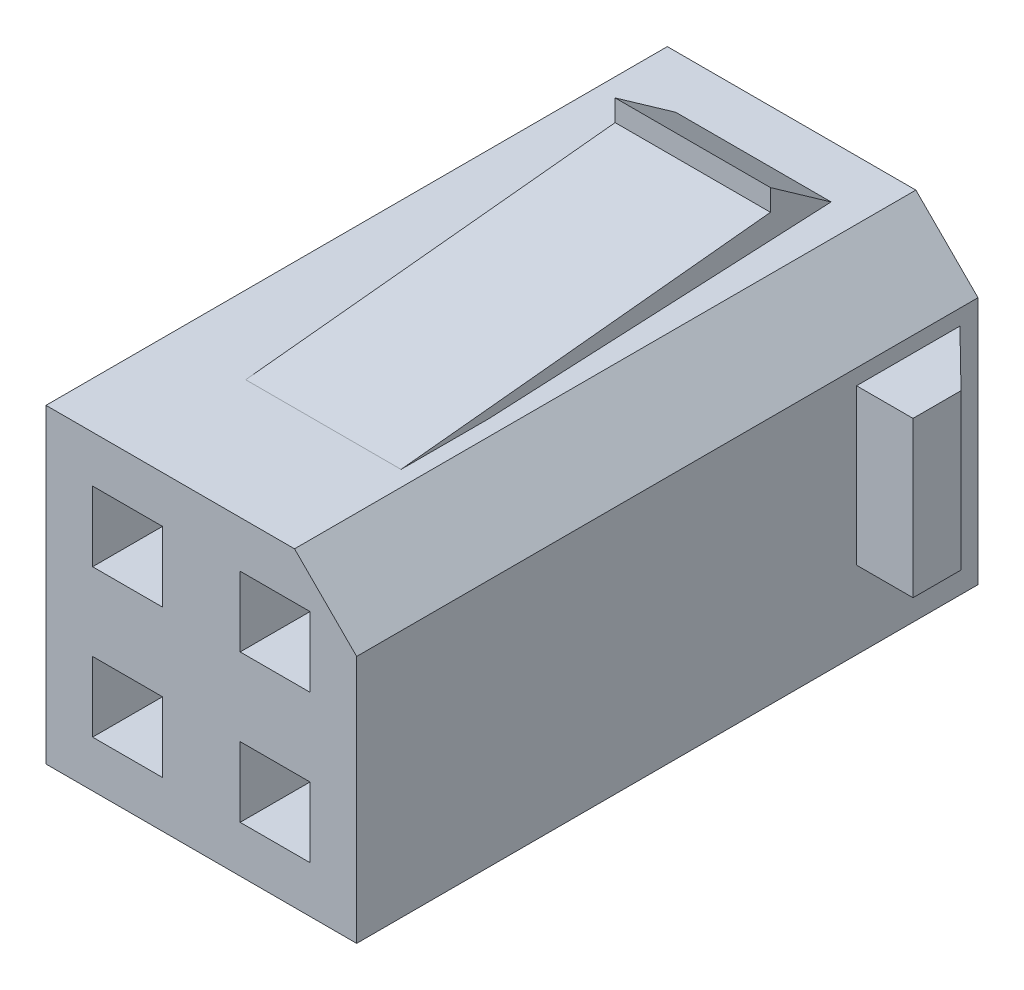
ISO-10303-21;
HEADER;
FILE_DESCRIPTION(('STEP AP214'),'2;1');
FILE_NAME('part.step','',(''),(''),'','','');
FILE_SCHEMA(('AUTOMOTIVE_DESIGN { 1 0 10303 214 1 1 1 1 }'));
ENDSEC;
DATA;
#1=APPLICATION_CONTEXT('core data for automotive mechanical design processes');
#2=APPLICATION_PROTOCOL_DEFINITION('international standard','automotive_design',2000,#1);
#3=PRODUCT_CONTEXT('',#1,'mechanical');
#4=PRODUCT('Part','Part','',(#3));
#5=PRODUCT_RELATED_PRODUCT_CATEGORY('part','',(#4));
#6=PRODUCT_DEFINITION_FORMATION('','',#4);
#7=PRODUCT_DEFINITION_CONTEXT('part definition',#1,'design');
#8=PRODUCT_DEFINITION('design','',#6,#7);
#9=PRODUCT_DEFINITION_SHAPE('','',#8);
#10=(LENGTH_UNIT() NAMED_UNIT(*) SI_UNIT(.MILLI.,.METRE.));
#11=(NAMED_UNIT(*) PLANE_ANGLE_UNIT() SI_UNIT($,.RADIAN.));
#12=(NAMED_UNIT(*) SI_UNIT($,.STERADIAN.) SOLID_ANGLE_UNIT());
#13=UNCERTAINTY_MEASURE_WITH_UNIT(LENGTH_MEASURE(1.E-05),#10,'distance_accuracy_value','');
#14=(GEOMETRIC_REPRESENTATION_CONTEXT(3) GLOBAL_UNCERTAINTY_ASSIGNED_CONTEXT((#13)) GLOBAL_UNIT_ASSIGNED_CONTEXT((#10,
#11,#12)) REPRESENTATION_CONTEXT('',''));
#15=CARTESIAN_POINT('',(0.,0.,0.));
#16=DIRECTION('',(0.,0.,1.));
#17=DIRECTION('',(1.,0.,0.));
#18=AXIS2_PLACEMENT_3D('',#15,#16,#17);
#19=CARTESIAN_POINT('',(-5.,-5.,15.));
#20=DIRECTION('',(0.,1.,0.));
#21=DIRECTION('',(0.,0.,1.));
#22=AXIS2_PLACEMENT_3D('',#19,#20,#21);
#23=PLANE('',#22);
#24=DIRECTION('',(1.,0.,0.));
#25=VECTOR('',#24,1.);
#26=CARTESIAN_POINT('',(-5.,-5.,0.));
#27=LINE('',#26,#25);
#28=CARTESIAN_POINT('',(-5.,-5.,0.));
#29=VERTEX_POINT('',#28);
#30=CARTESIAN_POINT('',(5.,-5.,0.));
#31=VERTEX_POINT('',#30);
#32=EDGE_CURVE('E731',#29,#31,#27,.T.);
#33=ORIENTED_EDGE('',*,*,#32,.T.);
#34=DIRECTION('',(0.,0.,-1.));
#35=VECTOR('',#34,1.);
#36=CARTESIAN_POINT('',(5.,-5.,15.));
#37=LINE('',#36,#35);
#38=CARTESIAN_POINT('',(5.,-5.,20.));
#39=VERTEX_POINT('',#38);
#40=EDGE_CURVE('E11',#39,#31,#37,.T.);
#41=ORIENTED_EDGE('',*,*,#40,.F.);
#42=DIRECTION('',(1.,0.,0.));
#43=VECTOR('',#42,1.);
#44=CARTESIAN_POINT('',(-5.,-5.,20.));
#45=LINE('',#44,#43);
#46=CARTESIAN_POINT('',(-5.,-5.,20.));
#47=VERTEX_POINT('',#46);
#48=EDGE_CURVE('E578',#47,#39,#45,.T.);
#49=ORIENTED_EDGE('',*,*,#48,.F.);
#50=DIRECTION('',(0.,0.,-1.));
#51=VECTOR('',#50,1.);
#52=CARTESIAN_POINT('',(-5.,-5.,15.));
#53=LINE('',#52,#51);
#54=EDGE_CURVE('E742',#47,#29,#53,.T.);
#55=ORIENTED_EDGE('',*,*,#54,.T.);
#56=EDGE_LOOP('',(#33,#41,#49,#55));
#57=FACE_BOUND('',#56,.T.);
#58=DIRECTION('',(0.,0.,1.));
#59=VECTOR('',#58,1.);
#60=CARTESIAN_POINT('',(2.5,-5.,16.0720844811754));
#61=LINE('',#60,#59);
#62=CARTESIAN_POINT('',(2.5,-5.,13.2483930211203));
#63=VERTEX_POINT('',#62);
#64=CARTESIAN_POINT('',(2.5,-5.,16.0720844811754));
#65=VERTEX_POINT('',#64);
#66=EDGE_CURVE('E376',#63,#65,#61,.T.);
#67=ORIENTED_EDGE('',*,*,#66,.F.);
#68=DIRECTION('',(-1.,0.,0.));
#69=VECTOR('',#68,1.);
#70=CARTESIAN_POINT('',(2.5,-5.,13.2483930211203));
#71=LINE('',#70,#69);
#72=CARTESIAN_POINT('',(-2.5,-5.,13.2483930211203));
#73=VERTEX_POINT('',#72);
#74=EDGE_CURVE('E371',#63,#73,#71,.T.);
#75=ORIENTED_EDGE('',*,*,#74,.T.);
#76=DIRECTION('',(0.,0.,1.));
#77=VECTOR('',#76,1.);
#78=CARTESIAN_POINT('',(-2.5,-5.,16.0720844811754));
#79=LINE('',#78,#77);
#80=CARTESIAN_POINT('',(-2.5,-5.,16.0720844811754));
#81=VERTEX_POINT('',#80);
#82=EDGE_CURVE('E357',#73,#81,#79,.T.);
#83=ORIENTED_EDGE('',*,*,#82,.T.);
#84=DIRECTION('',(-1.,0.,0.));
#85=VECTOR('',#84,1.);
#86=CARTESIAN_POINT('',(2.5,-5.,16.0720844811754));
#87=LINE('',#86,#85);
#88=EDGE_CURVE('E378',#65,#81,#87,.T.);
#89=ORIENTED_EDGE('',*,*,#88,.F.);
#90=EDGE_LOOP('',(#67,#75,#83,#89));
#91=FACE_BOUND('',#90,.T.);
#92=ADVANCED_FACE('F30',(#57,#91),#23,.F.);
#93=CARTESIAN_POINT('',(5.,-5.,0.));
#94=DIRECTION('',(0.,0.,1.));
#95=DIRECTION('',(1.,0.,0.));
#96=AXIS2_PLACEMENT_3D('',#93,#94,#95);
#97=PLANE('',#96);
#98=DIRECTION('',(0.,-1.,0.));
#99=VECTOR('',#98,1.);
#100=CARTESIAN_POINT('',(0.25,-0.25,0.));
#101=LINE('',#100,#99);
#102=CARTESIAN_POINT('',(0.25,-0.25,0.));
#103=VERTEX_POINT('',#102);
#104=CARTESIAN_POINT('',(0.250000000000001,-4.5,0.));
#105=VERTEX_POINT('',#104);
#106=EDGE_CURVE('E629',#103,#105,#101,.T.);
#107=ORIENTED_EDGE('',*,*,#106,.T.);
#108=DIRECTION('',(1.,0.,0.));
#109=VECTOR('',#108,1.);
#110=CARTESIAN_POINT('',(0.250000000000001,-4.5,0.));
#111=LINE('',#110,#109);
#112=CARTESIAN_POINT('',(4.5,-4.5,0.));
#113=VERTEX_POINT('',#112);
#114=EDGE_CURVE('E632',#105,#113,#111,.T.);
#115=ORIENTED_EDGE('',*,*,#114,.T.);
#116=DIRECTION('',(0.,1.,0.));
#117=VECTOR('',#116,1.);
#118=CARTESIAN_POINT('',(4.5,-0.25,0.));
#119=LINE('',#118,#117);
#120=CARTESIAN_POINT('',(4.5,-0.25,0.));
#121=VERTEX_POINT('',#120);
#122=EDGE_CURVE('E635',#113,#121,#119,.T.);
#123=ORIENTED_EDGE('',*,*,#122,.T.);
#124=DIRECTION('',(-1.,0.,0.));
#125=VECTOR('',#124,1.);
#126=CARTESIAN_POINT('',(0.25,-0.25,0.));
#127=LINE('',#126,#125);
#128=EDGE_CURVE('E638',#121,#103,#127,.T.);
#129=ORIENTED_EDGE('',*,*,#128,.T.);
#130=EDGE_LOOP('',(#107,#115,#123,#129));
#131=FACE_BOUND('',#130,.T.);
#132=DIRECTION('',(1.,0.,0.));
#133=VECTOR('',#132,1.);
#134=CARTESIAN_POINT('',(-4.5,0.25,0.));
#135=LINE('',#134,#133);
#136=CARTESIAN_POINT('',(-4.5,0.25,0.));
#137=VERTEX_POINT('',#136);
#138=CARTESIAN_POINT('',(-0.25,0.25,0.));
#139=VERTEX_POINT('',#138);
#140=EDGE_CURVE('E700',#137,#139,#135,.T.);
#141=ORIENTED_EDGE('',*,*,#140,.T.);
#142=DIRECTION('',(0.,1.,0.));
#143=VECTOR('',#142,1.);
#144=CARTESIAN_POINT('',(-0.25,4.5,0.));
#145=LINE('',#144,#143);
#146=CARTESIAN_POINT('',(-0.25,4.5,0.));
#147=VERTEX_POINT('',#146);
#148=EDGE_CURVE('E703',#139,#147,#145,.T.);
#149=ORIENTED_EDGE('',*,*,#148,.T.);
#150=DIRECTION('',(-1.,0.,0.));
#151=VECTOR('',#150,1.);
#152=CARTESIAN_POINT('',(-4.5,4.5,0.));
#153=LINE('',#152,#151);
#154=CARTESIAN_POINT('',(-4.5,4.5,0.));
#155=VERTEX_POINT('',#154);
#156=EDGE_CURVE('E706',#147,#155,#153,.T.);
#157=ORIENTED_EDGE('',*,*,#156,.T.);
#158=DIRECTION('',(0.,-1.,0.));
#159=VECTOR('',#158,1.);
#160=CARTESIAN_POINT('',(-4.5,4.5,0.));
#161=LINE('',#160,#159);
#162=EDGE_CURVE('E697',#155,#137,#161,.T.);
#163=ORIENTED_EDGE('',*,*,#162,.T.);
#164=EDGE_LOOP('',(#141,#149,#157,#163));
#165=FACE_BOUND('',#164,.T.);
#166=ORIENTED_EDGE('',*,*,#32,.F.);
#167=DIRECTION('',(0.,-1.,0.));
#168=VECTOR('',#167,1.);
#169=CARTESIAN_POINT('',(-5.,5.,0.));
#170=LINE('',#169,#168);
#171=CARTESIAN_POINT('',(-5.,5.,0.));
#172=VERTEX_POINT('',#171);
#173=EDGE_CURVE('E740',#172,#29,#170,.T.);
#174=ORIENTED_EDGE('',*,*,#173,.F.);
#175=DIRECTION('',(-1.,0.,0.));
#176=VECTOR('',#175,1.);
#177=CARTESIAN_POINT('',(3.,5.,0.));
#178=LINE('',#177,#176);
#179=CARTESIAN_POINT('',(3.,5.,0.));
#180=VERTEX_POINT('',#179);
#181=EDGE_CURVE('E738',#180,#172,#178,.T.);
#182=ORIENTED_EDGE('',*,*,#181,.F.);
#183=DIRECTION('',(-0.707106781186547,0.707106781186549,0.));
#184=VECTOR('',#183,1.);
#185=CARTESIAN_POINT('',(5.,3.,0.));
#186=LINE('',#185,#184);
#187=CARTESIAN_POINT('',(5.,3.,0.));
#188=VERTEX_POINT('',#187);
#189=EDGE_CURVE('E736',#188,#180,#186,.T.);
#190=ORIENTED_EDGE('',*,*,#189,.F.);
#191=DIRECTION('',(0.,1.,0.));
#192=VECTOR('',#191,1.);
#193=CARTESIAN_POINT('',(5.,-5.,0.));
#194=LINE('',#193,#192);
#195=EDGE_CURVE('E734',#31,#188,#194,.T.);
#196=ORIENTED_EDGE('',*,*,#195,.F.);
#197=EDGE_LOOP('',(#166,#174,#182,#190,#196));
#198=FACE_BOUND('',#197,.T.);
#199=DIRECTION('',(0.,-1.,0.));
#200=VECTOR('',#199,1.);
#201=CARTESIAN_POINT('',(-4.5,-0.25,0.));
#202=LINE('',#201,#200);
#203=CARTESIAN_POINT('',(-4.5,-0.25,0.));
#204=VERTEX_POINT('',#203);
#205=CARTESIAN_POINT('',(-4.5,-4.5,0.));
#206=VERTEX_POINT('',#205);
#207=EDGE_CURVE('E663',#204,#206,#202,.T.);
#208=ORIENTED_EDGE('',*,*,#207,.T.);
#209=DIRECTION('',(1.,0.,0.));
#210=VECTOR('',#209,1.);
#211=CARTESIAN_POINT('',(-4.5,-4.5,0.));
#212=LINE('',#211,#210);
#213=CARTESIAN_POINT('',(-0.249999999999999,-4.5,0.));
#214=VERTEX_POINT('',#213);
#215=EDGE_CURVE('E666',#206,#214,#212,.T.);
#216=ORIENTED_EDGE('',*,*,#215,.T.);
#217=DIRECTION('',(0.,1.,0.));
#218=VECTOR('',#217,1.);
#219=CARTESIAN_POINT('',(-0.25,-0.25,0.));
#220=LINE('',#219,#218);
#221=CARTESIAN_POINT('',(-0.25,-0.25,0.));
#222=VERTEX_POINT('',#221);
#223=EDGE_CURVE('E669',#214,#222,#220,.T.);
#224=ORIENTED_EDGE('',*,*,#223,.T.);
#225=DIRECTION('',(-1.,0.,0.));
#226=VECTOR('',#225,1.);
#227=CARTESIAN_POINT('',(-4.5,-0.25,0.));
#228=LINE('',#227,#226);
#229=EDGE_CURVE('E672',#222,#204,#228,.T.);
#230=ORIENTED_EDGE('',*,*,#229,.T.);
#231=EDGE_LOOP('',(#208,#216,#224,#230));
#232=FACE_BOUND('',#231,.T.);
#233=DIRECTION('',(0.,-1.,0.));
#234=VECTOR('',#233,1.);
#235=CARTESIAN_POINT('',(0.249999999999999,4.5,0.));
#236=LINE('',#235,#234);
#237=CARTESIAN_POINT('',(0.249999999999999,4.5,0.));
#238=VERTEX_POINT('',#237);
#239=CARTESIAN_POINT('',(0.25,0.25,0.));
#240=VERTEX_POINT('',#239);
#241=EDGE_CURVE('E587',#238,#240,#236,.T.);
#242=ORIENTED_EDGE('',*,*,#241,.T.);
#243=DIRECTION('',(1.,0.,0.));
#244=VECTOR('',#243,1.);
#245=CARTESIAN_POINT('',(0.25,0.25,0.));
#246=LINE('',#245,#244);
#247=CARTESIAN_POINT('',(4.5,0.25,0.));
#248=VERTEX_POINT('',#247);
#249=EDGE_CURVE('E590',#240,#248,#246,.T.);
#250=ORIENTED_EDGE('',*,*,#249,.T.);
#251=DIRECTION('',(0.,1.,0.));
#252=VECTOR('',#251,1.);
#253=CARTESIAN_POINT('',(4.5,2.79289321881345,0.));
#254=LINE('',#253,#252);
#255=CARTESIAN_POINT('',(4.5,2.79289321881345,0.));
#256=VERTEX_POINT('',#255);
#257=EDGE_CURVE('E593',#248,#256,#254,.T.);
#258=ORIENTED_EDGE('',*,*,#257,.T.);
#259=DIRECTION('',(-0.707106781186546,0.707106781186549,0.));
#260=VECTOR('',#259,1.);
#261=CARTESIAN_POINT('',(2.79289321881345,4.5,0.));
#262=LINE('',#261,#260);
#263=CARTESIAN_POINT('',(2.79289321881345,4.5,0.));
#264=VERTEX_POINT('',#263);
#265=EDGE_CURVE('E596',#256,#264,#262,.T.);
#266=ORIENTED_EDGE('',*,*,#265,.T.);
#267=DIRECTION('',(-1.,0.,0.));
#268=VECTOR('',#267,1.);
#269=CARTESIAN_POINT('',(0.249999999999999,4.5,0.));
#270=LINE('',#269,#268);
#271=EDGE_CURVE('E599',#264,#238,#270,.T.);
#272=ORIENTED_EDGE('',*,*,#271,.T.);
#273=EDGE_LOOP('',(#242,#250,#258,#266,#272));
#274=FACE_BOUND('',#273,.T.);
#275=ADVANCED_FACE('F760',(#131,#165,#198,#232,#274),#97,.F.);
#276=CARTESIAN_POINT('',(5.,-5.,15.));
#277=DIRECTION('',(-1.,0.,0.));
#278=DIRECTION('',(0.,-1.,0.));
#279=AXIS2_PLACEMENT_3D('',#276,#277,#278);
#280=PLANE('',#279);
#281=DIRECTION('',(0.,-1.,0.));
#282=VECTOR('',#281,1.);
#283=CARTESIAN_POINT('',(4.99999999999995,2.5,3.90968508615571));
#284=LINE('',#283,#282);
#285=CARTESIAN_POINT('',(5.,2.5,3.90968508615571));
#286=VERTEX_POINT('',#285);
#287=CARTESIAN_POINT('',(5.,-2.5,3.90968508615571));
#288=VERTEX_POINT('',#287);
#289=EDGE_CURVE('E445',#286,#288,#284,.T.);
#290=ORIENTED_EDGE('',*,*,#289,.F.);
#291=DIRECTION('',(0.,0.,1.));
#292=VECTOR('',#291,1.);
#293=CARTESIAN_POINT('',(4.99999999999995,2.5,3.90968508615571));
#294=LINE('',#293,#292);
#295=CARTESIAN_POINT('',(5.,2.5,0.58229352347));
#296=VERTEX_POINT('',#295);
#297=EDGE_CURVE('E427',#296,#286,#294,.T.);
#298=ORIENTED_EDGE('',*,*,#297,.F.);
#299=DIRECTION('',(0.,-1.,0.));
#300=VECTOR('',#299,1.);
#301=CARTESIAN_POINT('',(5.,2.5,0.582293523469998));
#302=LINE('',#301,#300);
#303=CARTESIAN_POINT('',(5.,-2.5,0.582293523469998));
#304=VERTEX_POINT('',#303);
#305=EDGE_CURVE('E437',#296,#304,#302,.T.);
#306=ORIENTED_EDGE('',*,*,#305,.T.);
#307=DIRECTION('',(0.,0.,1.));
#308=VECTOR('',#307,1.);
#309=CARTESIAN_POINT('',(4.99999999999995,-2.5,3.90968508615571));
#310=LINE('',#309,#308);
#311=EDGE_CURVE('E418',#304,#288,#310,.T.);
#312=ORIENTED_EDGE('',*,*,#311,.T.);
#313=EDGE_LOOP('',(#290,#298,#306,#312));
#314=FACE_BOUND('',#313,.T.);
#315=ORIENTED_EDGE('',*,*,#195,.T.);
#316=DIRECTION('',(0.,0.,-1.));
#317=VECTOR('',#316,1.);
#318=CARTESIAN_POINT('',(5.,3.,15.));
#319=LINE('',#318,#317);
#320=CARTESIAN_POINT('',(5.,3.,20.));
#321=VERTEX_POINT('',#320);
#322=EDGE_CURVE('E37',#321,#188,#319,.T.);
#323=ORIENTED_EDGE('',*,*,#322,.F.);
#324=DIRECTION('',(0.,1.,0.));
#325=VECTOR('',#324,1.);
#326=CARTESIAN_POINT('',(5.,-5.,20.));
#327=LINE('',#326,#325);
#328=EDGE_CURVE('E581',#39,#321,#327,.T.);
#329=ORIENTED_EDGE('',*,*,#328,.F.);
#330=ORIENTED_EDGE('',*,*,#40,.T.);
#331=EDGE_LOOP('',(#315,#323,#329,#330));
#332=FACE_BOUND('',#331,.T.);
#333=ADVANCED_FACE('F773',(#314,#332),#280,.F.);
#334=CARTESIAN_POINT('',(5.,3.,15.));
#335=DIRECTION('',(-0.707106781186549,-0.707106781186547,0.));
#336=DIRECTION('',(0.707106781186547,-0.707106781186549,0.));
#337=AXIS2_PLACEMENT_3D('',#334,#335,#336);
#338=PLANE('',#337);
#339=ORIENTED_EDGE('',*,*,#189,.T.);
#340=DIRECTION('',(0.,0.,-1.));
#341=VECTOR('',#340,1.);
#342=CARTESIAN_POINT('',(3.,5.,15.));
#343=LINE('',#342,#341);
#344=CARTESIAN_POINT('',(3.,5.,20.));
#345=VERTEX_POINT('',#344);
#346=EDGE_CURVE('E748',#345,#180,#343,.T.);
#347=ORIENTED_EDGE('',*,*,#346,.F.);
#348=DIRECTION('',(-0.707106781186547,0.707106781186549,0.));
#349=VECTOR('',#348,1.);
#350=CARTESIAN_POINT('',(5.,3.,20.));
#351=LINE('',#350,#349);
#352=EDGE_CURVE('E584',#321,#345,#351,.T.);
#353=ORIENTED_EDGE('',*,*,#352,.F.);
#354=ORIENTED_EDGE('',*,*,#322,.T.);
#355=EDGE_LOOP('',(#339,#347,#353,#354));
#356=FACE_BOUND('',#355,.T.);
#357=ADVANCED_FACE('F754',(#356),#338,.F.);
#358=CARTESIAN_POINT('',(3.,5.,15.));
#359=DIRECTION('',(0.,-1.,0.));
#360=DIRECTION('',(1.,0.,0.));
#361=AXIS2_PLACEMENT_3D('',#358,#359,#360);
#362=PLANE('',#361);
#363=DIRECTION('',(-1.,0.,0.));
#364=VECTOR('',#363,1.);
#365=CARTESIAN_POINT('',(2.5,5.,13.2483930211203));
#366=LINE('',#365,#364);
#367=CARTESIAN_POINT('',(2.5,5.,13.2483930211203));
#368=VERTEX_POINT('',#367);
#369=CARTESIAN_POINT('',(-2.5,5.,13.2483930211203));
#370=VERTEX_POINT('',#369);
#371=EDGE_CURVE('E52',#368,#370,#366,.T.);
#372=ORIENTED_EDGE('',*,*,#371,.F.);
#373=DIRECTION('',(0.,0.,-1.));
#374=VECTOR('',#373,1.);
#375=CARTESIAN_POINT('',(2.5,5.,16.0720844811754));
#376=LINE('',#375,#374);
#377=CARTESIAN_POINT('',(2.5,5.,16.0720844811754));
#378=VERTEX_POINT('',#377);
#379=EDGE_CURVE('E394',#378,#368,#376,.T.);
#380=ORIENTED_EDGE('',*,*,#379,.F.);
#381=DIRECTION('',(-1.,0.,0.));
#382=VECTOR('',#381,1.);
#383=CARTESIAN_POINT('',(2.5,5.,16.0720844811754));
#384=LINE('',#383,#382);
#385=CARTESIAN_POINT('',(-2.5,5.,16.0720844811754));
#386=VERTEX_POINT('',#385);
#387=EDGE_CURVE('E406',#378,#386,#384,.T.);
#388=ORIENTED_EDGE('',*,*,#387,.T.);
#389=DIRECTION('',(0.,0.,-1.));
#390=VECTOR('',#389,1.);
#391=CARTESIAN_POINT('',(-2.5,5.,16.0720844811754));
#392=LINE('',#391,#390);
#393=EDGE_CURVE('E377',#386,#370,#392,.T.);
#394=ORIENTED_EDGE('',*,*,#393,.T.);
#395=EDGE_LOOP('',(#372,#380,#388,#394));
#396=FACE_BOUND('',#395,.T.);
#397=ORIENTED_EDGE('',*,*,#181,.T.);
#398=DIRECTION('',(0.,0.,-1.));
#399=VECTOR('',#398,1.);
#400=CARTESIAN_POINT('',(-5.,5.,15.));
#401=LINE('',#400,#399);
#402=CARTESIAN_POINT('',(-5.,5.,20.));
#403=VERTEX_POINT('',#402);
#404=EDGE_CURVE('E745',#403,#172,#401,.T.);
#405=ORIENTED_EDGE('',*,*,#404,.F.);
#406=DIRECTION('',(-1.,0.,0.));
#407=VECTOR('',#406,1.);
#408=CARTESIAN_POINT('',(3.,5.,20.));
#409=LINE('',#408,#407);
#410=EDGE_CURVE('E572',#345,#403,#409,.T.);
#411=ORIENTED_EDGE('',*,*,#410,.F.);
#412=ORIENTED_EDGE('',*,*,#346,.T.);
#413=EDGE_LOOP('',(#397,#405,#411,#412));
#414=FACE_BOUND('',#413,.T.);
#415=ADVANCED_FACE('F764',(#396,#414),#362,.F.);
#416=CARTESIAN_POINT('',(-5.,5.,15.));
#417=DIRECTION('',(1.,0.,0.));
#418=DIRECTION('',(0.,1.,0.));
#419=AXIS2_PLACEMENT_3D('',#416,#417,#418);
#420=PLANE('',#419);
#421=ORIENTED_EDGE('',*,*,#173,.T.);
#422=ORIENTED_EDGE('',*,*,#54,.F.);
#423=DIRECTION('',(0.,-1.,0.));
#424=VECTOR('',#423,1.);
#425=CARTESIAN_POINT('',(-5.,5.,20.));
#426=LINE('',#425,#424);
#427=EDGE_CURVE('E575',#403,#47,#426,.T.);
#428=ORIENTED_EDGE('',*,*,#427,.F.);
#429=ORIENTED_EDGE('',*,*,#404,.T.);
#430=EDGE_LOOP('',(#421,#422,#428,#429));
#431=FACE_BOUND('',#430,.T.);
#432=ADVANCED_FACE('F768',(#431),#420,.F.);
#433=CARTESIAN_POINT('',(-4.5,4.5,15.));
#434=DIRECTION('',(1.,0.,0.));
#435=DIRECTION('',(0.,1.,0.));
#436=AXIS2_PLACEMENT_3D('',#433,#434,#435);
#437=PLANE('',#436);
#438=ORIENTED_EDGE('',*,*,#162,.F.);
#439=DIRECTION('',(0.,0.,-1.));
#440=VECTOR('',#439,1.);
#441=CARTESIAN_POINT('',(-4.5,4.5,15.));
#442=LINE('',#441,#440);
#443=CARTESIAN_POINT('',(-4.5,4.5,15.));
#444=VERTEX_POINT('',#443);
#445=EDGE_CURVE('E721',#444,#155,#442,.T.);
#446=ORIENTED_EDGE('',*,*,#445,.F.);
#447=DIRECTION('',(0.,-1.,0.));
#448=VECTOR('',#447,1.);
#449=CARTESIAN_POINT('',(-4.5,4.5,15.));
#450=LINE('',#449,#448);
#451=CARTESIAN_POINT('',(-4.5,0.25,15.));
#452=VERTEX_POINT('',#451);
#453=EDGE_CURVE('E709',#444,#452,#450,.T.);
#454=ORIENTED_EDGE('',*,*,#453,.T.);
#455=DIRECTION('',(0.,0.,-1.));
#456=VECTOR('',#455,1.);
#457=CARTESIAN_POINT('',(-4.5,0.25,15.));
#458=LINE('',#457,#456);
#459=EDGE_CURVE('E728',#452,#137,#458,.T.);
#460=ORIENTED_EDGE('',*,*,#459,.T.);
#461=EDGE_LOOP('',(#438,#446,#454,#460));
#462=FACE_BOUND('',#461,.T.);
#463=ADVANCED_FACE('F788',(#462),#437,.T.);
#464=CARTESIAN_POINT('',(-4.5,0.25,15.));
#465=DIRECTION('',(0.,1.,0.));
#466=DIRECTION('',(-1.,0.,0.));
#467=AXIS2_PLACEMENT_3D('',#464,#465,#466);
#468=PLANE('',#467);
#469=ORIENTED_EDGE('',*,*,#140,.F.);
#470=ORIENTED_EDGE('',*,*,#459,.F.);
#471=DIRECTION('',(1.,0.,0.));
#472=VECTOR('',#471,1.);
#473=CARTESIAN_POINT('',(-4.5,0.25,15.));
#474=LINE('',#473,#472);
#475=CARTESIAN_POINT('',(-0.25,0.25,15.));
#476=VERTEX_POINT('',#475);
#477=EDGE_CURVE('E712',#452,#476,#474,.T.);
#478=ORIENTED_EDGE('',*,*,#477,.T.);
#479=DIRECTION('',(0.,0.,-1.));
#480=VECTOR('',#479,1.);
#481=CARTESIAN_POINT('',(-0.25,0.25,15.));
#482=LINE('',#481,#480);
#483=EDGE_CURVE('E726',#476,#139,#482,.T.);
#484=ORIENTED_EDGE('',*,*,#483,.T.);
#485=EDGE_LOOP('',(#469,#470,#478,#484));
#486=FACE_BOUND('',#485,.T.);
#487=ADVANCED_FACE('F815',(#486),#468,.T.);
#488=CARTESIAN_POINT('',(-0.25,4.5,15.));
#489=DIRECTION('',(-1.,0.,0.));
#490=DIRECTION('',(0.,-1.,0.));
#491=AXIS2_PLACEMENT_3D('',#488,#489,#490);
#492=PLANE('',#491);
#493=ORIENTED_EDGE('',*,*,#148,.F.);
#494=ORIENTED_EDGE('',*,*,#483,.F.);
#495=DIRECTION('',(0.,1.,0.));
#496=VECTOR('',#495,1.);
#497=CARTESIAN_POINT('',(-0.25,4.5,15.));
#498=LINE('',#497,#496);
#499=CARTESIAN_POINT('',(-0.25,4.5,15.));
#500=VERTEX_POINT('',#499);
#501=EDGE_CURVE('E715',#476,#500,#498,.T.);
#502=ORIENTED_EDGE('',*,*,#501,.T.);
#503=DIRECTION('',(0.,0.,-1.));
#504=VECTOR('',#503,1.);
#505=CARTESIAN_POINT('',(-0.25,4.5,15.));
#506=LINE('',#505,#504);
#507=EDGE_CURVE('E723',#500,#147,#506,.T.);
#508=ORIENTED_EDGE('',*,*,#507,.T.);
#509=EDGE_LOOP('',(#493,#494,#502,#508));
#510=FACE_BOUND('',#509,.T.);
#511=ADVANCED_FACE('F822',(#510),#492,.T.);
#512=CARTESIAN_POINT('',(-4.5,4.5,15.));
#513=DIRECTION('',(0.,-1.,0.));
#514=DIRECTION('',(0.,0.,-1.));
#515=AXIS2_PLACEMENT_3D('',#512,#513,#514);
#516=PLANE('',#515);
#517=ORIENTED_EDGE('',*,*,#156,.F.);
#518=ORIENTED_EDGE('',*,*,#507,.F.);
#519=DIRECTION('',(-1.,0.,0.));
#520=VECTOR('',#519,1.);
#521=CARTESIAN_POINT('',(-4.5,4.5,15.));
#522=LINE('',#521,#520);
#523=EDGE_CURVE('E718',#500,#444,#522,.T.);
#524=ORIENTED_EDGE('',*,*,#523,.T.);
#525=ORIENTED_EDGE('',*,*,#445,.T.);
#526=EDGE_LOOP('',(#517,#518,#524,#525));
#527=FACE_BOUND('',#526,.T.);
#528=ADVANCED_FACE('F829',(#527),#516,.T.);
#529=CARTESIAN_POINT('',(-4.5,-0.25,15.));
#530=DIRECTION('',(1.,0.,0.));
#531=DIRECTION('',(0.,1.,0.));
#532=AXIS2_PLACEMENT_3D('',#529,#530,#531);
#533=PLANE('',#532);
#534=ORIENTED_EDGE('',*,*,#207,.F.);
#535=DIRECTION('',(0.,0.,-1.));
#536=VECTOR('',#535,1.);
#537=CARTESIAN_POINT('',(-4.5,-0.25,15.));
#538=LINE('',#537,#536);
#539=CARTESIAN_POINT('',(-4.5,-0.25,15.));
#540=VERTEX_POINT('',#539);
#541=EDGE_CURVE('E687',#540,#204,#538,.T.);
#542=ORIENTED_EDGE('',*,*,#541,.F.);
#543=DIRECTION('',(0.,-1.,0.));
#544=VECTOR('',#543,1.);
#545=CARTESIAN_POINT('',(-4.5,-0.25,15.));
#546=LINE('',#545,#544);
#547=CARTESIAN_POINT('',(-4.5,-4.5,15.));
#548=VERTEX_POINT('',#547);
#549=EDGE_CURVE('E675',#540,#548,#546,.T.);
#550=ORIENTED_EDGE('',*,*,#549,.T.);
#551=DIRECTION('',(0.,0.,-1.));
#552=VECTOR('',#551,1.);
#553=CARTESIAN_POINT('',(-4.5,-4.5,15.));
#554=LINE('',#553,#552);
#555=EDGE_CURVE('E694',#548,#206,#554,.T.);
#556=ORIENTED_EDGE('',*,*,#555,.T.);
#557=EDGE_LOOP('',(#534,#542,#550,#556));
#558=FACE_BOUND('',#557,.T.);
#559=ADVANCED_FACE('F837',(#558),#533,.T.);
#560=CARTESIAN_POINT('',(-4.5,-4.5,15.));
#561=DIRECTION('',(0.,1.,0.));
#562=DIRECTION('',(0.,0.,1.));
#563=AXIS2_PLACEMENT_3D('',#560,#561,#562);
#564=PLANE('',#563);
#565=ORIENTED_EDGE('',*,*,#215,.F.);
#566=ORIENTED_EDGE('',*,*,#555,.F.);
#567=DIRECTION('',(1.,0.,0.));
#568=VECTOR('',#567,1.);
#569=CARTESIAN_POINT('',(-4.5,-4.5,15.));
#570=LINE('',#569,#568);
#571=CARTESIAN_POINT('',(-0.249999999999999,-4.5,15.));
#572=VERTEX_POINT('',#571);
#573=EDGE_CURVE('E678',#548,#572,#570,.T.);
#574=ORIENTED_EDGE('',*,*,#573,.T.);
#575=DIRECTION('',(0.,0.,-1.));
#576=VECTOR('',#575,1.);
#577=CARTESIAN_POINT('',(-0.249999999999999,-4.5,15.));
#578=LINE('',#577,#576);
#579=EDGE_CURVE('E692',#572,#214,#578,.T.);
#580=ORIENTED_EDGE('',*,*,#579,.T.);
#581=EDGE_LOOP('',(#565,#566,#574,#580));
#582=FACE_BOUND('',#581,.T.);
#583=ADVANCED_FACE('F845',(#582),#564,.T.);
#584=CARTESIAN_POINT('',(-0.25,-0.25,15.));
#585=DIRECTION('',(-1.,0.,0.));
#586=DIRECTION('',(0.,-1.,0.));
#587=AXIS2_PLACEMENT_3D('',#584,#585,#586);
#588=PLANE('',#587);
#589=ORIENTED_EDGE('',*,*,#223,.F.);
#590=ORIENTED_EDGE('',*,*,#579,.F.);
#591=DIRECTION('',(0.,1.,0.));
#592=VECTOR('',#591,1.);
#593=CARTESIAN_POINT('',(-0.25,-0.25,15.));
#594=LINE('',#593,#592);
#595=CARTESIAN_POINT('',(-0.25,-0.25,15.));
#596=VERTEX_POINT('',#595);
#597=EDGE_CURVE('E681',#572,#596,#594,.T.);
#598=ORIENTED_EDGE('',*,*,#597,.T.);
#599=DIRECTION('',(0.,0.,-1.));
#600=VECTOR('',#599,1.);
#601=CARTESIAN_POINT('',(-0.25,-0.25,15.));
#602=LINE('',#601,#600);
#603=EDGE_CURVE('E690',#596,#222,#602,.T.);
#604=ORIENTED_EDGE('',*,*,#603,.T.);
#605=EDGE_LOOP('',(#589,#590,#598,#604));
#606=FACE_BOUND('',#605,.T.);
#607=ADVANCED_FACE('F853',(#606),#588,.T.);
#608=CARTESIAN_POINT('',(-4.5,-0.25,15.));
#609=DIRECTION('',(0.,-1.,0.));
#610=DIRECTION('',(0.,0.,-1.));
#611=AXIS2_PLACEMENT_3D('',#608,#609,#610);
#612=PLANE('',#611);
#613=ORIENTED_EDGE('',*,*,#229,.F.);
#614=ORIENTED_EDGE('',*,*,#603,.F.);
#615=DIRECTION('',(-1.,0.,0.));
#616=VECTOR('',#615,1.);
#617=CARTESIAN_POINT('',(-4.5,-0.25,15.));
#618=LINE('',#617,#616);
#619=EDGE_CURVE('E684',#596,#540,#618,.T.);
#620=ORIENTED_EDGE('',*,*,#619,.T.);
#621=ORIENTED_EDGE('',*,*,#541,.T.);
#622=EDGE_LOOP('',(#613,#614,#620,#621));
#623=FACE_BOUND('',#622,.T.);
#624=ADVANCED_FACE('F861',(#623),#612,.T.);
#625=CARTESIAN_POINT('',(0.25,-0.25,15.));
#626=DIRECTION('',(1.,0.,0.));
#627=DIRECTION('',(0.,1.,0.));
#628=AXIS2_PLACEMENT_3D('',#625,#626,#627);
#629=PLANE('',#628);
#630=ORIENTED_EDGE('',*,*,#106,.F.);
#631=DIRECTION('',(0.,0.,-1.));
#632=VECTOR('',#631,1.);
#633=CARTESIAN_POINT('',(0.25,-0.25,15.));
#634=LINE('',#633,#632);
#635=CARTESIAN_POINT('',(0.25,-0.25,15.));
#636=VERTEX_POINT('',#635);
#637=EDGE_CURVE('E653',#636,#103,#634,.T.);
#638=ORIENTED_EDGE('',*,*,#637,.F.);
#639=DIRECTION('',(0.,-1.,0.));
#640=VECTOR('',#639,1.);
#641=CARTESIAN_POINT('',(0.25,-0.25,15.));
#642=LINE('',#641,#640);
#643=CARTESIAN_POINT('',(0.250000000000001,-4.5,15.));
#644=VERTEX_POINT('',#643);
#645=EDGE_CURVE('E641',#636,#644,#642,.T.);
#646=ORIENTED_EDGE('',*,*,#645,.T.);
#647=DIRECTION('',(0.,0.,-1.));
#648=VECTOR('',#647,1.);
#649=CARTESIAN_POINT('',(0.250000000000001,-4.5,15.));
#650=LINE('',#649,#648);
#651=EDGE_CURVE('E660',#644,#105,#650,.T.);
#652=ORIENTED_EDGE('',*,*,#651,.T.);
#653=EDGE_LOOP('',(#630,#638,#646,#652));
#654=FACE_BOUND('',#653,.T.);
#655=ADVANCED_FACE('F869',(#654),#629,.T.);
#656=CARTESIAN_POINT('',(0.250000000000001,-4.5,15.));
#657=DIRECTION('',(0.,1.,0.));
#658=DIRECTION('',(0.,0.,1.));
#659=AXIS2_PLACEMENT_3D('',#656,#657,#658);
#660=PLANE('',#659);
#661=ORIENTED_EDGE('',*,*,#114,.F.);
#662=ORIENTED_EDGE('',*,*,#651,.F.);
#663=DIRECTION('',(1.,0.,0.));
#664=VECTOR('',#663,1.);
#665=CARTESIAN_POINT('',(0.250000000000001,-4.5,15.));
#666=LINE('',#665,#664);
#667=CARTESIAN_POINT('',(4.5,-4.5,15.));
#668=VERTEX_POINT('',#667);
#669=EDGE_CURVE('E644',#644,#668,#666,.T.);
#670=ORIENTED_EDGE('',*,*,#669,.T.);
#671=DIRECTION('',(0.,0.,-1.));
#672=VECTOR('',#671,1.);
#673=CARTESIAN_POINT('',(4.5,-4.5,15.));
#674=LINE('',#673,#672);
#675=EDGE_CURVE('E658',#668,#113,#674,.T.);
#676=ORIENTED_EDGE('',*,*,#675,.T.);
#677=EDGE_LOOP('',(#661,#662,#670,#676));
#678=FACE_BOUND('',#677,.T.);
#679=ADVANCED_FACE('F877',(#678),#660,.T.);
#680=CARTESIAN_POINT('',(4.5,-0.25,15.));
#681=DIRECTION('',(-1.,0.,0.));
#682=DIRECTION('',(0.,-1.,0.));
#683=AXIS2_PLACEMENT_3D('',#680,#681,#682);
#684=PLANE('',#683);
#685=ORIENTED_EDGE('',*,*,#122,.F.);
#686=ORIENTED_EDGE('',*,*,#675,.F.);
#687=DIRECTION('',(0.,1.,0.));
#688=VECTOR('',#687,1.);
#689=CARTESIAN_POINT('',(4.5,-0.25,15.));
#690=LINE('',#689,#688);
#691=CARTESIAN_POINT('',(4.5,-0.25,15.));
#692=VERTEX_POINT('',#691);
#693=EDGE_CURVE('E647',#668,#692,#690,.T.);
#694=ORIENTED_EDGE('',*,*,#693,.T.);
#695=DIRECTION('',(0.,0.,-1.));
#696=VECTOR('',#695,1.);
#697=CARTESIAN_POINT('',(4.5,-0.25,15.));
#698=LINE('',#697,#696);
#699=EDGE_CURVE('E656',#692,#121,#698,.T.);
#700=ORIENTED_EDGE('',*,*,#699,.T.);
#701=EDGE_LOOP('',(#685,#686,#694,#700));
#702=FACE_BOUND('',#701,.T.);
#703=ADVANCED_FACE('F885',(#702),#684,.T.);
#704=CARTESIAN_POINT('',(0.25,-0.25,15.));
#705=DIRECTION('',(0.,-1.,0.));
#706=DIRECTION('',(0.,0.,-1.));
#707=AXIS2_PLACEMENT_3D('',#704,#705,#706);
#708=PLANE('',#707);
#709=ORIENTED_EDGE('',*,*,#128,.F.);
#710=ORIENTED_EDGE('',*,*,#699,.F.);
#711=DIRECTION('',(-1.,0.,0.));
#712=VECTOR('',#711,1.);
#713=CARTESIAN_POINT('',(0.25,-0.25,15.));
#714=LINE('',#713,#712);
#715=EDGE_CURVE('E650',#692,#636,#714,.T.);
#716=ORIENTED_EDGE('',*,*,#715,.T.);
#717=ORIENTED_EDGE('',*,*,#637,.T.);
#718=EDGE_LOOP('',(#709,#710,#716,#717));
#719=FACE_BOUND('',#718,.T.);
#720=ADVANCED_FACE('F893',(#719),#708,.T.);
#721=CARTESIAN_POINT('',(0.249999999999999,4.5,15.));
#722=DIRECTION('',(1.,0.,0.));
#723=DIRECTION('',(0.,1.,0.));
#724=AXIS2_PLACEMENT_3D('',#721,#722,#723);
#725=PLANE('',#724);
#726=ORIENTED_EDGE('',*,*,#241,.F.);
#727=DIRECTION('',(0.,0.,-1.));
#728=VECTOR('',#727,1.);
#729=CARTESIAN_POINT('',(0.249999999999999,4.5,15.));
#730=LINE('',#729,#728);
#731=CARTESIAN_POINT('',(0.249999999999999,4.5,15.));
#732=VERTEX_POINT('',#731);
#733=EDGE_CURVE('E617',#732,#238,#730,.T.);
#734=ORIENTED_EDGE('',*,*,#733,.F.);
#735=DIRECTION('',(0.,-1.,0.));
#736=VECTOR('',#735,1.);
#737=CARTESIAN_POINT('',(0.249999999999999,4.5,15.));
#738=LINE('',#737,#736);
#739=CARTESIAN_POINT('',(0.25,0.25,15.));
#740=VERTEX_POINT('',#739);
#741=EDGE_CURVE('E602',#732,#740,#738,.T.);
#742=ORIENTED_EDGE('',*,*,#741,.T.);
#743=DIRECTION('',(0.,0.,-1.));
#744=VECTOR('',#743,1.);
#745=CARTESIAN_POINT('',(0.25,0.25,15.));
#746=LINE('',#745,#744);
#747=EDGE_CURVE('E626',#740,#240,#746,.T.);
#748=ORIENTED_EDGE('',*,*,#747,.T.);
#749=EDGE_LOOP('',(#726,#734,#742,#748));
#750=FACE_BOUND('',#749,.T.);
#751=ADVANCED_FACE('F901',(#750),#725,.T.);
#752=CARTESIAN_POINT('',(0.25,0.25,15.));
#753=DIRECTION('',(0.,1.,0.));
#754=DIRECTION('',(0.,0.,1.));
#755=AXIS2_PLACEMENT_3D('',#752,#753,#754);
#756=PLANE('',#755);
#757=ORIENTED_EDGE('',*,*,#249,.F.);
#758=ORIENTED_EDGE('',*,*,#747,.F.);
#759=DIRECTION('',(1.,0.,0.));
#760=VECTOR('',#759,1.);
#761=CARTESIAN_POINT('',(0.25,0.25,15.));
#762=LINE('',#761,#760);
#763=CARTESIAN_POINT('',(4.5,0.25,15.));
#764=VERTEX_POINT('',#763);
#765=EDGE_CURVE('E605',#740,#764,#762,.T.);
#766=ORIENTED_EDGE('',*,*,#765,.T.);
#767=DIRECTION('',(0.,0.,-1.));
#768=VECTOR('',#767,1.);
#769=CARTESIAN_POINT('',(4.5,0.25,15.));
#770=LINE('',#769,#768);
#771=EDGE_CURVE('E624',#764,#248,#770,.T.);
#772=ORIENTED_EDGE('',*,*,#771,.T.);
#773=EDGE_LOOP('',(#757,#758,#766,#772));
#774=FACE_BOUND('',#773,.T.);
#775=ADVANCED_FACE('F909',(#774),#756,.T.);
#776=CARTESIAN_POINT('',(4.5,2.79289321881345,15.));
#777=DIRECTION('',(-1.,0.,0.));
#778=DIRECTION('',(0.,0.,1.));
#779=AXIS2_PLACEMENT_3D('',#776,#777,#778);
#780=PLANE('',#779);
#781=ORIENTED_EDGE('',*,*,#257,.F.);
#782=ORIENTED_EDGE('',*,*,#771,.F.);
#783=DIRECTION('',(0.,1.,0.));
#784=VECTOR('',#783,1.);
#785=CARTESIAN_POINT('',(4.5,2.79289321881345,15.));
#786=LINE('',#785,#784);
#787=CARTESIAN_POINT('',(4.5,2.79289321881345,15.));
#788=VERTEX_POINT('',#787);
#789=EDGE_CURVE('E608',#764,#788,#786,.T.);
#790=ORIENTED_EDGE('',*,*,#789,.T.);
#791=DIRECTION('',(0.,0.,-1.));
#792=VECTOR('',#791,1.);
#793=CARTESIAN_POINT('',(4.5,2.79289321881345,15.));
#794=LINE('',#793,#792);
#795=EDGE_CURVE('E622',#788,#256,#794,.T.);
#796=ORIENTED_EDGE('',*,*,#795,.T.);
#797=EDGE_LOOP('',(#781,#782,#790,#796));
#798=FACE_BOUND('',#797,.T.);
#799=ADVANCED_FACE('F917',(#798),#780,.T.);
#800=CARTESIAN_POINT('',(2.79289321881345,4.5,15.));
#801=DIRECTION('',(-0.707106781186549,-0.707106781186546,0.));
#802=DIRECTION('',(0.707106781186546,-0.707106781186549,0.));
#803=AXIS2_PLACEMENT_3D('',#800,#801,#802);
#804=PLANE('',#803);
#805=ORIENTED_EDGE('',*,*,#265,.F.);
#806=ORIENTED_EDGE('',*,*,#795,.F.);
#807=DIRECTION('',(-0.707106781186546,0.707106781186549,0.));
#808=VECTOR('',#807,1.);
#809=CARTESIAN_POINT('',(2.79289321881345,4.5,15.));
#810=LINE('',#809,#808);
#811=CARTESIAN_POINT('',(2.79289321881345,4.5,15.));
#812=VERTEX_POINT('',#811);
#813=EDGE_CURVE('E611',#788,#812,#810,.T.);
#814=ORIENTED_EDGE('',*,*,#813,.T.);
#815=DIRECTION('',(0.,0.,-1.));
#816=VECTOR('',#815,1.);
#817=CARTESIAN_POINT('',(2.79289321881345,4.5,15.));
#818=LINE('',#817,#816);
#819=EDGE_CURVE('E620',#812,#264,#818,.T.);
#820=ORIENTED_EDGE('',*,*,#819,.T.);
#821=EDGE_LOOP('',(#805,#806,#814,#820));
#822=FACE_BOUND('',#821,.T.);
#823=ADVANCED_FACE('F925',(#822),#804,.T.);
#824=CARTESIAN_POINT('',(0.249999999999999,4.5,15.));
#825=DIRECTION('',(0.,-1.,0.));
#826=DIRECTION('',(0.,0.,-1.));
#827=AXIS2_PLACEMENT_3D('',#824,#825,#826);
#828=PLANE('',#827);
#829=ORIENTED_EDGE('',*,*,#271,.F.);
#830=ORIENTED_EDGE('',*,*,#819,.F.);
#831=DIRECTION('',(-1.,0.,0.));
#832=VECTOR('',#831,1.);
#833=CARTESIAN_POINT('',(0.249999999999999,4.5,15.));
#834=LINE('',#833,#832);
#835=EDGE_CURVE('E614',#812,#732,#834,.T.);
#836=ORIENTED_EDGE('',*,*,#835,.T.);
#837=ORIENTED_EDGE('',*,*,#733,.T.);
#838=EDGE_LOOP('',(#829,#830,#836,#837));
#839=FACE_BOUND('',#838,.T.);
#840=ADVANCED_FACE('F933',(#839),#828,.T.);
#841=CARTESIAN_POINT('',(5.,5.,15.));
#842=DIRECTION('',(0.,0.,-1.));
#843=DIRECTION('',(-1.,0.,0.));
#844=AXIS2_PLACEMENT_3D('',#841,#842,#843);
#845=PLANE('',#844);
#846=ORIENTED_EDGE('',*,*,#477,.F.);
#847=ORIENTED_EDGE('',*,*,#453,.F.);
#848=ORIENTED_EDGE('',*,*,#523,.F.);
#849=ORIENTED_EDGE('',*,*,#501,.F.);
#850=EDGE_LOOP('',(#846,#847,#848,#849));
#851=FACE_BOUND('',#850,.T.);
#852=DIRECTION('',(0.,-1.,0.));
#853=VECTOR('',#852,1.);
#854=CARTESIAN_POINT('',(-3.5,3.5,15.));
#855=LINE('',#854,#853);
#856=CARTESIAN_POINT('',(-3.5,3.5,15.));
#857=VERTEX_POINT('',#856);
#858=CARTESIAN_POINT('',(-3.5,1.25,15.));
#859=VERTEX_POINT('',#858);
#860=EDGE_CURVE('E541',#857,#859,#855,.T.);
#861=ORIENTED_EDGE('',*,*,#860,.T.);
#862=DIRECTION('',(1.,0.,0.));
#863=VECTOR('',#862,1.);
#864=CARTESIAN_POINT('',(-3.5,1.25,15.));
#865=LINE('',#864,#863);
#866=CARTESIAN_POINT('',(-1.25,1.25,15.));
#867=VERTEX_POINT('',#866);
#868=EDGE_CURVE('E544',#859,#867,#865,.T.);
#869=ORIENTED_EDGE('',*,*,#868,.T.);
#870=DIRECTION('',(0.,1.,0.));
#871=VECTOR('',#870,1.);
#872=CARTESIAN_POINT('',(-1.25,3.5,15.));
#873=LINE('',#872,#871);
#874=CARTESIAN_POINT('',(-1.25,3.5,15.));
#875=VERTEX_POINT('',#874);
#876=EDGE_CURVE('E547',#867,#875,#873,.T.);
#877=ORIENTED_EDGE('',*,*,#876,.T.);
#878=DIRECTION('',(-1.,0.,0.));
#879=VECTOR('',#878,1.);
#880=CARTESIAN_POINT('',(-3.5,3.5,15.));
#881=LINE('',#880,#879);
#882=EDGE_CURVE('E550',#875,#857,#881,.T.);
#883=ORIENTED_EDGE('',*,*,#882,.T.);
#884=EDGE_LOOP('',(#861,#869,#877,#883));
#885=FACE_BOUND('',#884,.T.);
#886=ADVANCED_FACE('F941',(#851,#885),#845,.T.);
#887=ORIENTED_EDGE('',*,*,#573,.F.);
#888=ORIENTED_EDGE('',*,*,#549,.F.);
#889=ORIENTED_EDGE('',*,*,#619,.F.);
#890=ORIENTED_EDGE('',*,*,#597,.F.);
#891=EDGE_LOOP('',(#887,#888,#889,#890));
#892=FACE_BOUND('',#891,.T.);
#893=DIRECTION('',(0.,-1.,0.));
#894=VECTOR('',#893,1.);
#895=CARTESIAN_POINT('',(-3.5,-1.25,15.));
#896=LINE('',#895,#894);
#897=CARTESIAN_POINT('',(-3.5,-1.25,15.));
#898=VERTEX_POINT('',#897);
#899=CARTESIAN_POINT('',(-3.5,-3.5,15.));
#900=VERTEX_POINT('',#899);
#901=EDGE_CURVE('E479',#898,#900,#896,.T.);
#902=ORIENTED_EDGE('',*,*,#901,.T.);
#903=DIRECTION('',(1.,0.,0.));
#904=VECTOR('',#903,1.);
#905=CARTESIAN_POINT('',(-3.5,-3.5,15.));
#906=LINE('',#905,#904);
#907=CARTESIAN_POINT('',(-1.25,-3.5,15.));
#908=VERTEX_POINT('',#907);
#909=EDGE_CURVE('E482',#900,#908,#906,.T.);
#910=ORIENTED_EDGE('',*,*,#909,.T.);
#911=DIRECTION('',(0.,1.,0.));
#912=VECTOR('',#911,1.);
#913=CARTESIAN_POINT('',(-1.25,-1.25,15.));
#914=LINE('',#913,#912);
#915=CARTESIAN_POINT('',(-1.25,-1.25,15.));
#916=VERTEX_POINT('',#915);
#917=EDGE_CURVE('E485',#908,#916,#914,.T.);
#918=ORIENTED_EDGE('',*,*,#917,.T.);
#919=DIRECTION('',(-1.,0.,0.));
#920=VECTOR('',#919,1.);
#921=CARTESIAN_POINT('',(-3.5,-1.25,15.));
#922=LINE('',#921,#920);
#923=EDGE_CURVE('E488',#916,#898,#922,.T.);
#924=ORIENTED_EDGE('',*,*,#923,.T.);
#925=EDGE_LOOP('',(#902,#910,#918,#924));
#926=FACE_BOUND('',#925,.T.);
#927=ADVANCED_FACE('F949',(#892,#926),#845,.T.);
#928=ORIENTED_EDGE('',*,*,#669,.F.);
#929=ORIENTED_EDGE('',*,*,#645,.F.);
#930=ORIENTED_EDGE('',*,*,#715,.F.);
#931=ORIENTED_EDGE('',*,*,#693,.F.);
#932=EDGE_LOOP('',(#928,#929,#930,#931));
#933=FACE_BOUND('',#932,.T.);
#934=DIRECTION('',(-1.,0.,0.));
#935=VECTOR('',#934,1.);
#936=CARTESIAN_POINT('',(1.25,-1.25,15.));
#937=LINE('',#936,#935);
#938=CARTESIAN_POINT('',(3.5,-1.25,15.));
#939=VERTEX_POINT('',#938);
#940=CARTESIAN_POINT('',(1.25,-1.25,15.));
#941=VERTEX_POINT('',#940);
#942=EDGE_CURVE('E457',#939,#941,#937,.T.);
#943=ORIENTED_EDGE('',*,*,#942,.T.);
#944=DIRECTION('',(0.,-1.,0.));
#945=VECTOR('',#944,1.);
#946=CARTESIAN_POINT('',(1.25,-1.25,15.));
#947=LINE('',#946,#945);
#948=CARTESIAN_POINT('',(1.25,-3.5,15.));
#949=VERTEX_POINT('',#948);
#950=EDGE_CURVE('E448',#941,#949,#947,.T.);
#951=ORIENTED_EDGE('',*,*,#950,.T.);
#952=DIRECTION('',(1.,0.,0.));
#953=VECTOR('',#952,1.);
#954=CARTESIAN_POINT('',(1.25,-3.5,15.));
#955=LINE('',#954,#953);
#956=CARTESIAN_POINT('',(3.5,-3.5,15.));
#957=VERTEX_POINT('',#956);
#958=EDGE_CURVE('E451',#949,#957,#955,.T.);
#959=ORIENTED_EDGE('',*,*,#958,.T.);
#960=DIRECTION('',(0.,1.,0.));
#961=VECTOR('',#960,1.);
#962=CARTESIAN_POINT('',(3.5,-1.25,15.));
#963=LINE('',#962,#961);
#964=EDGE_CURVE('E454',#957,#939,#963,.T.);
#965=ORIENTED_EDGE('',*,*,#964,.T.);
#966=EDGE_LOOP('',(#943,#951,#959,#965));
#967=FACE_BOUND('',#966,.T.);
#968=ADVANCED_FACE('F958',(#933,#967),#845,.T.);
#969=CARTESIAN_POINT('',(5.,5.,20.));
#970=DIRECTION('',(0.,0.,-1.));
#971=DIRECTION('',(-1.,0.,0.));
#972=AXIS2_PLACEMENT_3D('',#969,#970,#971);
#973=PLANE('',#972);
#974=DIRECTION('',(0.,-1.,0.));
#975=VECTOR('',#974,1.);
#976=CARTESIAN_POINT('',(-3.5,-1.25,20.));
#977=LINE('',#976,#975);
#978=CARTESIAN_POINT('',(-3.5,-1.25,20.));
#979=VERTEX_POINT('',#978);
#980=CARTESIAN_POINT('',(-3.5,-3.5,20.));
#981=VERTEX_POINT('',#980);
#982=EDGE_CURVE('E491',#979,#981,#977,.T.);
#983=ORIENTED_EDGE('',*,*,#982,.F.);
#984=DIRECTION('',(-1.,0.,0.));
#985=VECTOR('',#984,1.);
#986=CARTESIAN_POINT('',(-3.5,-1.25,20.));
#987=LINE('',#986,#985);
#988=CARTESIAN_POINT('',(-1.25,-1.25,20.));
#989=VERTEX_POINT('',#988);
#990=EDGE_CURVE('E498',#989,#979,#987,.T.);
#991=ORIENTED_EDGE('',*,*,#990,.F.);
#992=DIRECTION('',(0.,1.,0.));
#993=VECTOR('',#992,1.);
#994=CARTESIAN_POINT('',(-1.25,-1.25,20.));
#995=LINE('',#994,#993);
#996=CARTESIAN_POINT('',(-1.25,-3.5,20.));
#997=VERTEX_POINT('',#996);
#998=EDGE_CURVE('E495',#997,#989,#995,.T.);
#999=ORIENTED_EDGE('',*,*,#998,.F.);
#1000=DIRECTION('',(1.,0.,0.));
#1001=VECTOR('',#1000,1.);
#1002=CARTESIAN_POINT('',(-3.5,-3.5,20.));
#1003=LINE('',#1002,#1001);
#1004=EDGE_CURVE('E493',#981,#997,#1003,.T.);
#1005=ORIENTED_EDGE('',*,*,#1004,.F.);
#1006=EDGE_LOOP('',(#983,#991,#999,#1005));
#1007=FACE_BOUND('',#1006,.T.);
#1008=DIRECTION('',(0.,-1.,0.));
#1009=VECTOR('',#1008,1.);
#1010=CARTESIAN_POINT('',(-3.5,3.5,20.));
#1011=LINE('',#1010,#1009);
#1012=CARTESIAN_POINT('',(-3.5,3.5,20.));
#1013=VERTEX_POINT('',#1012);
#1014=CARTESIAN_POINT('',(-3.5,1.25,20.));
#1015=VERTEX_POINT('',#1014);
#1016=EDGE_CURVE('E553',#1013,#1015,#1011,.T.);
#1017=ORIENTED_EDGE('',*,*,#1016,.F.);
#1018=DIRECTION('',(-1.,0.,0.));
#1019=VECTOR('',#1018,1.);
#1020=CARTESIAN_POINT('',(-3.5,3.5,20.));
#1021=LINE('',#1020,#1019);
#1022=CARTESIAN_POINT('',(-1.25,3.5,20.));
#1023=VERTEX_POINT('',#1022);
#1024=EDGE_CURVE('E560',#1023,#1013,#1021,.T.);
#1025=ORIENTED_EDGE('',*,*,#1024,.F.);
#1026=DIRECTION('',(0.,1.,0.));
#1027=VECTOR('',#1026,1.);
#1028=CARTESIAN_POINT('',(-1.25,3.5,20.));
#1029=LINE('',#1028,#1027);
#1030=CARTESIAN_POINT('',(-1.25,1.25,20.));
#1031=VERTEX_POINT('',#1030);
#1032=EDGE_CURVE('E557',#1031,#1023,#1029,.T.);
#1033=ORIENTED_EDGE('',*,*,#1032,.F.);
#1034=DIRECTION('',(1.,0.,0.));
#1035=VECTOR('',#1034,1.);
#1036=CARTESIAN_POINT('',(-3.5,1.25,20.));
#1037=LINE('',#1036,#1035);
#1038=EDGE_CURVE('E555',#1015,#1031,#1037,.T.);
#1039=ORIENTED_EDGE('',*,*,#1038,.F.);
#1040=EDGE_LOOP('',(#1017,#1025,#1033,#1039));
#1041=FACE_BOUND('',#1040,.T.);
#1042=ORIENTED_EDGE('',*,*,#410,.T.);
#1043=ORIENTED_EDGE('',*,*,#427,.T.);
#1044=ORIENTED_EDGE('',*,*,#48,.T.);
#1045=ORIENTED_EDGE('',*,*,#328,.T.);
#1046=ORIENTED_EDGE('',*,*,#352,.T.);
#1047=EDGE_LOOP('',(#1042,#1043,#1044,#1045,#1046));
#1048=FACE_BOUND('',#1047,.T.);
#1049=DIRECTION('',(0.,-1.,0.));
#1050=VECTOR('',#1049,1.);
#1051=CARTESIAN_POINT('',(1.25,3.5,20.));
#1052=LINE('',#1051,#1050);
#1053=CARTESIAN_POINT('',(1.25,3.5,20.));
#1054=VERTEX_POINT('',#1053);
#1055=CARTESIAN_POINT('',(1.25,1.25,20.));
#1056=VERTEX_POINT('',#1055);
#1057=EDGE_CURVE('E522',#1054,#1056,#1052,.T.);
#1058=ORIENTED_EDGE('',*,*,#1057,.F.);
#1059=DIRECTION('',(-1.,0.,0.));
#1060=VECTOR('',#1059,1.);
#1061=CARTESIAN_POINT('',(1.25,3.5,20.));
#1062=LINE('',#1061,#1060);
#1063=CARTESIAN_POINT('',(3.5,3.5,20.));
#1064=VERTEX_POINT('',#1063);
#1065=EDGE_CURVE('E529',#1064,#1054,#1062,.T.);
#1066=ORIENTED_EDGE('',*,*,#1065,.F.);
#1067=DIRECTION('',(0.,1.,0.));
#1068=VECTOR('',#1067,1.);
#1069=CARTESIAN_POINT('',(3.5,3.5,20.));
#1070=LINE('',#1069,#1068);
#1071=CARTESIAN_POINT('',(3.5,1.25,20.));
#1072=VERTEX_POINT('',#1071);
#1073=EDGE_CURVE('E526',#1072,#1064,#1070,.T.);
#1074=ORIENTED_EDGE('',*,*,#1073,.F.);
#1075=DIRECTION('',(1.,0.,0.));
#1076=VECTOR('',#1075,1.);
#1077=CARTESIAN_POINT('',(1.25,1.25,20.));
#1078=LINE('',#1077,#1076);
#1079=EDGE_CURVE('E524',#1056,#1072,#1078,.T.);
#1080=ORIENTED_EDGE('',*,*,#1079,.F.);
#1081=EDGE_LOOP('',(#1058,#1066,#1074,#1080));
#1082=FACE_BOUND('',#1081,.T.);
#1083=DIRECTION('',(1.,0.,0.));
#1084=VECTOR('',#1083,1.);
#1085=CARTESIAN_POINT('',(1.25,-3.5,20.));
#1086=LINE('',#1085,#1084);
#1087=CARTESIAN_POINT('',(1.25,-3.5,20.));
#1088=VERTEX_POINT('',#1087);
#1089=CARTESIAN_POINT('',(3.5,-3.5,20.));
#1090=VERTEX_POINT('',#1089);
#1091=EDGE_CURVE('E462',#1088,#1090,#1086,.T.);
#1092=ORIENTED_EDGE('',*,*,#1091,.F.);
#1093=DIRECTION('',(0.,-1.,0.));
#1094=VECTOR('',#1093,1.);
#1095=CARTESIAN_POINT('',(1.25,-1.25,20.));
#1096=LINE('',#1095,#1094);
#1097=CARTESIAN_POINT('',(1.25,-1.25,20.));
#1098=VERTEX_POINT('',#1097);
#1099=EDGE_CURVE('E460',#1098,#1088,#1096,.T.);
#1100=ORIENTED_EDGE('',*,*,#1099,.F.);
#1101=DIRECTION('',(-1.,0.,0.));
#1102=VECTOR('',#1101,1.);
#1103=CARTESIAN_POINT('',(1.25,-1.25,20.));
#1104=LINE('',#1103,#1102);
#1105=CARTESIAN_POINT('',(3.5,-1.25,20.));
#1106=VERTEX_POINT('',#1105);
#1107=EDGE_CURVE('E467',#1106,#1098,#1104,.T.);
#1108=ORIENTED_EDGE('',*,*,#1107,.F.);
#1109=DIRECTION('',(0.,1.,0.));
#1110=VECTOR('',#1109,1.);
#1111=CARTESIAN_POINT('',(3.5,-1.25,20.));
#1112=LINE('',#1111,#1110);
#1113=EDGE_CURVE('E464',#1090,#1106,#1112,.T.);
#1114=ORIENTED_EDGE('',*,*,#1113,.F.);
#1115=EDGE_LOOP('',(#1092,#1100,#1108,#1114));
#1116=FACE_BOUND('',#1115,.T.);
#1117=ADVANCED_FACE('F771',(#1007,#1041,#1048,#1082,#1116),#973,.F.);
#1118=ORIENTED_EDGE('',*,*,#765,.F.);
#1119=ORIENTED_EDGE('',*,*,#741,.F.);
#1120=ORIENTED_EDGE('',*,*,#835,.F.);
#1121=ORIENTED_EDGE('',*,*,#813,.F.);
#1122=ORIENTED_EDGE('',*,*,#789,.F.);
#1123=EDGE_LOOP('',(#1118,#1119,#1120,#1121,#1122));
#1124=FACE_BOUND('',#1123,.T.);
#1125=DIRECTION('',(-1.,0.,0.));
#1126=VECTOR('',#1125,1.);
#1127=CARTESIAN_POINT('',(1.25,3.5,15.));
#1128=LINE('',#1127,#1126);
#1129=CARTESIAN_POINT('',(3.5,3.5,15.));
#1130=VERTEX_POINT('',#1129);
#1131=CARTESIAN_POINT('',(1.25,3.5,15.));
#1132=VERTEX_POINT('',#1131);
#1133=EDGE_CURVE('E519',#1130,#1132,#1128,.T.);
#1134=ORIENTED_EDGE('',*,*,#1133,.T.);
#1135=DIRECTION('',(0.,-1.,0.));
#1136=VECTOR('',#1135,1.);
#1137=CARTESIAN_POINT('',(1.25,3.5,15.));
#1138=LINE('',#1137,#1136);
#1139=CARTESIAN_POINT('',(1.25,1.25,15.));
#1140=VERTEX_POINT('',#1139);
#1141=EDGE_CURVE('E510',#1132,#1140,#1138,.T.);
#1142=ORIENTED_EDGE('',*,*,#1141,.T.);
#1143=DIRECTION('',(1.,0.,0.));
#1144=VECTOR('',#1143,1.);
#1145=CARTESIAN_POINT('',(1.25,1.25,15.));
#1146=LINE('',#1145,#1144);
#1147=CARTESIAN_POINT('',(3.5,1.25,15.));
#1148=VERTEX_POINT('',#1147);
#1149=EDGE_CURVE('E513',#1140,#1148,#1146,.T.);
#1150=ORIENTED_EDGE('',*,*,#1149,.T.);
#1151=DIRECTION('',(0.,1.,0.));
#1152=VECTOR('',#1151,1.);
#1153=CARTESIAN_POINT('',(3.5,3.5,15.));
#1154=LINE('',#1153,#1152);
#1155=EDGE_CURVE('E516',#1148,#1130,#1154,.T.);
#1156=ORIENTED_EDGE('',*,*,#1155,.T.);
#1157=EDGE_LOOP('',(#1134,#1142,#1150,#1156));
#1158=FACE_BOUND('',#1157,.T.);
#1159=ADVANCED_FACE('F952',(#1124,#1158),#845,.T.);
#1160=CARTESIAN_POINT('',(-3.5,3.5,20.));
#1161=DIRECTION('',(1.,0.,0.));
#1162=DIRECTION('',(0.,1.,0.));
#1163=AXIS2_PLACEMENT_3D('',#1160,#1161,#1162);
#1164=PLANE('',#1163);
#1165=ORIENTED_EDGE('',*,*,#860,.F.);
#1166=DIRECTION('',(0.,0.,-1.));
#1167=VECTOR('',#1166,1.);
#1168=CARTESIAN_POINT('',(-3.5,3.5,20.));
#1169=LINE('',#1168,#1167);
#1170=EDGE_CURVE('E562',#1013,#857,#1169,.T.);
#1171=ORIENTED_EDGE('',*,*,#1170,.F.);
#1172=ORIENTED_EDGE('',*,*,#1016,.T.);
#1173=DIRECTION('',(0.,0.,-1.));
#1174=VECTOR('',#1173,1.);
#1175=CARTESIAN_POINT('',(-3.5,1.25,20.));
#1176=LINE('',#1175,#1174);
#1177=EDGE_CURVE('E569',#1015,#859,#1176,.T.);
#1178=ORIENTED_EDGE('',*,*,#1177,.T.);
#1179=EDGE_LOOP('',(#1165,#1171,#1172,#1178));
#1180=FACE_BOUND('',#1179,.T.);
#1181=ADVANCED_FACE('F978',(#1180),#1164,.T.);
#1182=CARTESIAN_POINT('',(-3.5,1.25,20.));
#1183=DIRECTION('',(0.,1.,0.));
#1184=DIRECTION('',(0.,0.,1.));
#1185=AXIS2_PLACEMENT_3D('',#1182,#1183,#1184);
#1186=PLANE('',#1185);
#1187=ORIENTED_EDGE('',*,*,#868,.F.);
#1188=ORIENTED_EDGE('',*,*,#1177,.F.);
#1189=ORIENTED_EDGE('',*,*,#1038,.T.);
#1190=DIRECTION('',(0.,0.,-1.));
#1191=VECTOR('',#1190,1.);
#1192=CARTESIAN_POINT('',(-1.25,1.25,20.));
#1193=LINE('',#1192,#1191);
#1194=EDGE_CURVE('E567',#1031,#867,#1193,.T.);
#1195=ORIENTED_EDGE('',*,*,#1194,.T.);
#1196=EDGE_LOOP('',(#1187,#1188,#1189,#1195));
#1197=FACE_BOUND('',#1196,.T.);
#1198=ADVANCED_FACE('F985',(#1197),#1186,.T.);
#1199=CARTESIAN_POINT('',(-1.25,3.5,20.));
#1200=DIRECTION('',(-1.,0.,0.));
#1201=DIRECTION('',(0.,-1.,0.));
#1202=AXIS2_PLACEMENT_3D('',#1199,#1200,#1201);
#1203=PLANE('',#1202);
#1204=ORIENTED_EDGE('',*,*,#876,.F.);
#1205=ORIENTED_EDGE('',*,*,#1194,.F.);
#1206=ORIENTED_EDGE('',*,*,#1032,.T.);
#1207=DIRECTION('',(0.,0.,-1.));
#1208=VECTOR('',#1207,1.);
#1209=CARTESIAN_POINT('',(-1.25,3.5,20.));
#1210=LINE('',#1209,#1208);
#1211=EDGE_CURVE('E565',#1023,#875,#1210,.T.);
#1212=ORIENTED_EDGE('',*,*,#1211,.T.);
#1213=EDGE_LOOP('',(#1204,#1205,#1206,#1212));
#1214=FACE_BOUND('',#1213,.T.);
#1215=ADVANCED_FACE('F993',(#1214),#1203,.T.);
#1216=CARTESIAN_POINT('',(-3.5,3.5,20.));
#1217=DIRECTION('',(0.,-1.,0.));
#1218=DIRECTION('',(0.,0.,-1.));
#1219=AXIS2_PLACEMENT_3D('',#1216,#1217,#1218);
#1220=PLANE('',#1219);
#1221=ORIENTED_EDGE('',*,*,#882,.F.);
#1222=ORIENTED_EDGE('',*,*,#1211,.F.);
#1223=ORIENTED_EDGE('',*,*,#1024,.T.);
#1224=ORIENTED_EDGE('',*,*,#1170,.T.);
#1225=EDGE_LOOP('',(#1221,#1222,#1223,#1224));
#1226=FACE_BOUND('',#1225,.T.);
#1227=ADVANCED_FACE('F1001',(#1226),#1220,.T.);
#1228=CARTESIAN_POINT('',(1.25,3.5,20.));
#1229=DIRECTION('',(1.,0.,0.));
#1230=DIRECTION('',(0.,1.,0.));
#1231=AXIS2_PLACEMENT_3D('',#1228,#1229,#1230);
#1232=PLANE('',#1231);
#1233=ORIENTED_EDGE('',*,*,#1141,.F.);
#1234=DIRECTION('',(0.,0.,-1.));
#1235=VECTOR('',#1234,1.);
#1236=CARTESIAN_POINT('',(1.25,3.5,20.));
#1237=LINE('',#1236,#1235);
#1238=EDGE_CURVE('E531',#1054,#1132,#1237,.T.);
#1239=ORIENTED_EDGE('',*,*,#1238,.F.);
#1240=ORIENTED_EDGE('',*,*,#1057,.T.);
#1241=DIRECTION('',(0.,0.,-1.));
#1242=VECTOR('',#1241,1.);
#1243=CARTESIAN_POINT('',(1.25,1.25,20.));
#1244=LINE('',#1243,#1242);
#1245=EDGE_CURVE('E538',#1056,#1140,#1244,.T.);
#1246=ORIENTED_EDGE('',*,*,#1245,.T.);
#1247=EDGE_LOOP('',(#1233,#1239,#1240,#1246));
#1248=FACE_BOUND('',#1247,.T.);
#1249=ADVANCED_FACE('F1009',(#1248),#1232,.T.);
#1250=CARTESIAN_POINT('',(1.25,1.25,20.));
#1251=DIRECTION('',(0.,1.,0.));
#1252=DIRECTION('',(0.,0.,1.));
#1253=AXIS2_PLACEMENT_3D('',#1250,#1251,#1252);
#1254=PLANE('',#1253);
#1255=ORIENTED_EDGE('',*,*,#1149,.F.);
#1256=ORIENTED_EDGE('',*,*,#1245,.F.);
#1257=ORIENTED_EDGE('',*,*,#1079,.T.);
#1258=DIRECTION('',(0.,0.,-1.));
#1259=VECTOR('',#1258,1.);
#1260=CARTESIAN_POINT('',(3.5,1.25,20.));
#1261=LINE('',#1260,#1259);
#1262=EDGE_CURVE('E536',#1072,#1148,#1261,.T.);
#1263=ORIENTED_EDGE('',*,*,#1262,.T.);
#1264=EDGE_LOOP('',(#1255,#1256,#1257,#1263));
#1265=FACE_BOUND('',#1264,.T.);
#1266=ADVANCED_FACE('F1017',(#1265),#1254,.T.);
#1267=CARTESIAN_POINT('',(3.5,3.5,20.));
#1268=DIRECTION('',(-1.,0.,0.));
#1269=DIRECTION('',(0.,-1.,0.));
#1270=AXIS2_PLACEMENT_3D('',#1267,#1268,#1269);
#1271=PLANE('',#1270);
#1272=ORIENTED_EDGE('',*,*,#1155,.F.);
#1273=ORIENTED_EDGE('',*,*,#1262,.F.);
#1274=ORIENTED_EDGE('',*,*,#1073,.T.);
#1275=DIRECTION('',(0.,0.,-1.));
#1276=VECTOR('',#1275,1.);
#1277=CARTESIAN_POINT('',(3.5,3.5,20.));
#1278=LINE('',#1277,#1276);
#1279=EDGE_CURVE('E534',#1064,#1130,#1278,.T.);
#1280=ORIENTED_EDGE('',*,*,#1279,.T.);
#1281=EDGE_LOOP('',(#1272,#1273,#1274,#1280));
#1282=FACE_BOUND('',#1281,.T.);
#1283=ADVANCED_FACE('F1025',(#1282),#1271,.T.);
#1284=CARTESIAN_POINT('',(1.25,3.5,20.));
#1285=DIRECTION('',(0.,-1.,0.));
#1286=DIRECTION('',(0.,0.,-1.));
#1287=AXIS2_PLACEMENT_3D('',#1284,#1285,#1286);
#1288=PLANE('',#1287);
#1289=ORIENTED_EDGE('',*,*,#1133,.F.);
#1290=ORIENTED_EDGE('',*,*,#1279,.F.);
#1291=ORIENTED_EDGE('',*,*,#1065,.T.);
#1292=ORIENTED_EDGE('',*,*,#1238,.T.);
#1293=EDGE_LOOP('',(#1289,#1290,#1291,#1292));
#1294=FACE_BOUND('',#1293,.T.);
#1295=ADVANCED_FACE('F1033',(#1294),#1288,.T.);
#1296=CARTESIAN_POINT('',(-3.5,-1.25,20.));
#1297=DIRECTION('',(1.,0.,0.));
#1298=DIRECTION('',(0.,0.,-1.));
#1299=AXIS2_PLACEMENT_3D('',#1296,#1297,#1298);
#1300=PLANE('',#1299);
#1301=ORIENTED_EDGE('',*,*,#901,.F.);
#1302=DIRECTION('',(0.,0.,-1.));
#1303=VECTOR('',#1302,1.);
#1304=CARTESIAN_POINT('',(-3.5,-1.25,20.));
#1305=LINE('',#1304,#1303);
#1306=EDGE_CURVE('E500',#979,#898,#1305,.T.);
#1307=ORIENTED_EDGE('',*,*,#1306,.F.);
#1308=ORIENTED_EDGE('',*,*,#982,.T.);
#1309=DIRECTION('',(0.,0.,-1.));
#1310=VECTOR('',#1309,1.);
#1311=CARTESIAN_POINT('',(-3.5,-3.5,20.));
#1312=LINE('',#1311,#1310);
#1313=EDGE_CURVE('E507',#981,#900,#1312,.T.);
#1314=ORIENTED_EDGE('',*,*,#1313,.T.);
#1315=EDGE_LOOP('',(#1301,#1307,#1308,#1314));
#1316=FACE_BOUND('',#1315,.T.);
#1317=ADVANCED_FACE('F1041',(#1316),#1300,.T.);
#1318=CARTESIAN_POINT('',(-3.5,-3.5,20.));
#1319=DIRECTION('',(0.,1.,0.));
#1320=DIRECTION('',(0.,0.,1.));
#1321=AXIS2_PLACEMENT_3D('',#1318,#1319,#1320);
#1322=PLANE('',#1321);
#1323=ORIENTED_EDGE('',*,*,#909,.F.);
#1324=ORIENTED_EDGE('',*,*,#1313,.F.);
#1325=ORIENTED_EDGE('',*,*,#1004,.T.);
#1326=DIRECTION('',(0.,0.,-1.));
#1327=VECTOR('',#1326,1.);
#1328=CARTESIAN_POINT('',(-1.25,-3.5,20.));
#1329=LINE('',#1328,#1327);
#1330=EDGE_CURVE('E505',#997,#908,#1329,.T.);
#1331=ORIENTED_EDGE('',*,*,#1330,.T.);
#1332=EDGE_LOOP('',(#1323,#1324,#1325,#1331));
#1333=FACE_BOUND('',#1332,.T.);
#1334=ADVANCED_FACE('F1049',(#1333),#1322,.T.);
#1335=CARTESIAN_POINT('',(-1.25,-1.25,20.));
#1336=DIRECTION('',(-1.,0.,0.));
#1337=DIRECTION('',(0.,-1.,0.));
#1338=AXIS2_PLACEMENT_3D('',#1335,#1336,#1337);
#1339=PLANE('',#1338);
#1340=ORIENTED_EDGE('',*,*,#917,.F.);
#1341=ORIENTED_EDGE('',*,*,#1330,.F.);
#1342=ORIENTED_EDGE('',*,*,#998,.T.);
#1343=DIRECTION('',(0.,0.,-1.));
#1344=VECTOR('',#1343,1.);
#1345=CARTESIAN_POINT('',(-1.25,-1.25,20.));
#1346=LINE('',#1345,#1344);
#1347=EDGE_CURVE('E503',#989,#916,#1346,.T.);
#1348=ORIENTED_EDGE('',*,*,#1347,.T.);
#1349=EDGE_LOOP('',(#1340,#1341,#1342,#1348));
#1350=FACE_BOUND('',#1349,.T.);
#1351=ADVANCED_FACE('F1057',(#1350),#1339,.T.);
#1352=CARTESIAN_POINT('',(-3.5,-1.25,20.));
#1353=DIRECTION('',(0.,-1.,0.));
#1354=DIRECTION('',(0.,0.,-1.));
#1355=AXIS2_PLACEMENT_3D('',#1352,#1353,#1354);
#1356=PLANE('',#1355);
#1357=ORIENTED_EDGE('',*,*,#923,.F.);
#1358=ORIENTED_EDGE('',*,*,#1347,.F.);
#1359=ORIENTED_EDGE('',*,*,#990,.T.);
#1360=ORIENTED_EDGE('',*,*,#1306,.T.);
#1361=EDGE_LOOP('',(#1357,#1358,#1359,#1360));
#1362=FACE_BOUND('',#1361,.T.);
#1363=ADVANCED_FACE('F1065',(#1362),#1356,.T.);
#1364=CARTESIAN_POINT('',(1.25,-1.25,20.));
#1365=DIRECTION('',(1.,0.,0.));
#1366=DIRECTION('',(0.,1.,0.));
#1367=AXIS2_PLACEMENT_3D('',#1364,#1365,#1366);
#1368=PLANE('',#1367);
#1369=ORIENTED_EDGE('',*,*,#950,.F.);
#1370=DIRECTION('',(0.,0.,-1.));
#1371=VECTOR('',#1370,1.);
#1372=CARTESIAN_POINT('',(1.25,-1.25,20.));
#1373=LINE('',#1372,#1371);
#1374=EDGE_CURVE('E469',#1098,#941,#1373,.T.);
#1375=ORIENTED_EDGE('',*,*,#1374,.F.);
#1376=ORIENTED_EDGE('',*,*,#1099,.T.);
#1377=DIRECTION('',(0.,0.,-1.));
#1378=VECTOR('',#1377,1.);
#1379=CARTESIAN_POINT('',(1.25,-3.5,20.));
#1380=LINE('',#1379,#1378);
#1381=EDGE_CURVE('E476',#1088,#949,#1380,.T.);
#1382=ORIENTED_EDGE('',*,*,#1381,.T.);
#1383=EDGE_LOOP('',(#1369,#1375,#1376,#1382));
#1384=FACE_BOUND('',#1383,.T.);
#1385=ADVANCED_FACE('F1073',(#1384),#1368,.T.);
#1386=CARTESIAN_POINT('',(1.25,-3.5,20.));
#1387=DIRECTION('',(0.,1.,0.));
#1388=DIRECTION('',(0.,0.,1.));
#1389=AXIS2_PLACEMENT_3D('',#1386,#1387,#1388);
#1390=PLANE('',#1389);
#1391=ORIENTED_EDGE('',*,*,#958,.F.);
#1392=ORIENTED_EDGE('',*,*,#1381,.F.);
#1393=ORIENTED_EDGE('',*,*,#1091,.T.);
#1394=DIRECTION('',(0.,0.,-1.));
#1395=VECTOR('',#1394,1.);
#1396=CARTESIAN_POINT('',(3.5,-3.5,20.));
#1397=LINE('',#1396,#1395);
#1398=EDGE_CURVE('E474',#1090,#957,#1397,.T.);
#1399=ORIENTED_EDGE('',*,*,#1398,.T.);
#1400=EDGE_LOOP('',(#1391,#1392,#1393,#1399));
#1401=FACE_BOUND('',#1400,.T.);
#1402=ADVANCED_FACE('F1081',(#1401),#1390,.T.);
#1403=CARTESIAN_POINT('',(3.5,-1.25,20.));
#1404=DIRECTION('',(-1.,0.,0.));
#1405=DIRECTION('',(0.,-1.,0.));
#1406=AXIS2_PLACEMENT_3D('',#1403,#1404,#1405);
#1407=PLANE('',#1406);
#1408=ORIENTED_EDGE('',*,*,#964,.F.);
#1409=ORIENTED_EDGE('',*,*,#1398,.F.);
#1410=ORIENTED_EDGE('',*,*,#1113,.T.);
#1411=DIRECTION('',(0.,0.,-1.));
#1412=VECTOR('',#1411,1.);
#1413=CARTESIAN_POINT('',(3.5,-1.25,20.));
#1414=LINE('',#1413,#1412);
#1415=EDGE_CURVE('E472',#1106,#939,#1414,.T.);
#1416=ORIENTED_EDGE('',*,*,#1415,.T.);
#1417=EDGE_LOOP('',(#1408,#1409,#1410,#1416));
#1418=FACE_BOUND('',#1417,.T.);
#1419=ADVANCED_FACE('F1089',(#1418),#1407,.T.);
#1420=CARTESIAN_POINT('',(1.25,-1.25,20.));
#1421=DIRECTION('',(0.,-1.,0.));
#1422=DIRECTION('',(0.,0.,-1.));
#1423=AXIS2_PLACEMENT_3D('',#1420,#1421,#1422);
#1424=PLANE('',#1423);
#1425=ORIENTED_EDGE('',*,*,#942,.F.);
#1426=ORIENTED_EDGE('',*,*,#1415,.F.);
#1427=ORIENTED_EDGE('',*,*,#1107,.T.);
#1428=ORIENTED_EDGE('',*,*,#1374,.T.);
#1429=EDGE_LOOP('',(#1425,#1426,#1427,#1428));
#1430=FACE_BOUND('',#1429,.T.);
#1431=ADVANCED_FACE('F1097',(#1430),#1424,.T.);
#1432=CARTESIAN_POINT('',(6.81818181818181,2.5,3.90968508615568));
#1433=DIRECTION('',(0.,0.,-1.));
#1434=DIRECTION('',(-1.,0.,0.));
#1435=AXIS2_PLACEMENT_3D('',#1432,#1433,#1434);
#1436=PLANE('',#1435);
#1437=DIRECTION('',(1.,0.,0.));
#1438=VECTOR('',#1437,1.);
#1439=CARTESIAN_POINT('',(6.81818181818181,-2.5,3.90968508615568));
#1440=LINE('',#1439,#1438);
#1441=CARTESIAN_POINT('',(6.81818181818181,-2.5,3.90968508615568));
#1442=VERTEX_POINT('',#1441);
#1443=EDGE_CURVE('E420',#288,#1442,#1440,.T.);
#1444=ORIENTED_EDGE('',*,*,#1443,.T.);
#1445=DIRECTION('',(0.,-1.,0.));
#1446=VECTOR('',#1445,1.);
#1447=CARTESIAN_POINT('',(6.81818181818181,2.5,3.90968508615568));
#1448=LINE('',#1447,#1446);
#1449=CARTESIAN_POINT('',(6.81818181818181,2.5,3.90968508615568));
#1450=VERTEX_POINT('',#1449);
#1451=EDGE_CURVE('E442',#1450,#1442,#1448,.T.);
#1452=ORIENTED_EDGE('',*,*,#1451,.F.);
#1453=DIRECTION('',(1.,0.,0.));
#1454=VECTOR('',#1453,1.);
#1455=CARTESIAN_POINT('',(6.81818181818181,2.5,3.90968508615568));
#1456=LINE('',#1455,#1454);
#1457=EDGE_CURVE('E430',#286,#1450,#1456,.T.);
#1458=ORIENTED_EDGE('',*,*,#1457,.F.);
#1459=ORIENTED_EDGE('',*,*,#289,.T.);
#1460=EDGE_LOOP('',(#1444,#1452,#1458,#1459));
#1461=FACE_BOUND('',#1460,.T.);
#1462=ADVANCED_FACE('F1105',(#1461),#1436,.F.);
#1463=CARTESIAN_POINT('',(6.81818181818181,2.5,2.36482471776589));
#1464=DIRECTION('',(-1.,0.,0.));
#1465=DIRECTION('',(0.,0.,1.));
#1466=AXIS2_PLACEMENT_3D('',#1463,#1464,#1465);
#1467=PLANE('',#1466);
#1468=DIRECTION('',(0.,0.,-1.));
#1469=VECTOR('',#1468,1.);
#1470=CARTESIAN_POINT('',(6.81818181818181,-2.5,2.36482471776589));
#1471=LINE('',#1470,#1469);
#1472=CARTESIAN_POINT('',(6.81818181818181,-2.5,2.36482471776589));
#1473=VERTEX_POINT('',#1472);
#1474=EDGE_CURVE('E422',#1442,#1473,#1471,.T.);
#1475=ORIENTED_EDGE('',*,*,#1474,.T.);
#1476=DIRECTION('',(0.,-1.,0.));
#1477=VECTOR('',#1476,1.);
#1478=CARTESIAN_POINT('',(6.81818181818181,2.5,2.36482471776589));
#1479=LINE('',#1478,#1477);
#1480=CARTESIAN_POINT('',(6.81818181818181,2.5,2.36482471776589));
#1481=VERTEX_POINT('',#1480);
#1482=EDGE_CURVE('E439',#1481,#1473,#1479,.T.);
#1483=ORIENTED_EDGE('',*,*,#1482,.F.);
#1484=DIRECTION('',(0.,0.,-1.));
#1485=VECTOR('',#1484,1.);
#1486=CARTESIAN_POINT('',(6.81818181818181,2.5,2.36482471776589));
#1487=LINE('',#1486,#1485);
#1488=EDGE_CURVE('E432',#1450,#1481,#1487,.T.);
#1489=ORIENTED_EDGE('',*,*,#1488,.F.);
#1490=ORIENTED_EDGE('',*,*,#1451,.T.);
#1491=EDGE_LOOP('',(#1475,#1483,#1489,#1490));
#1492=FACE_BOUND('',#1491,.T.);
#1493=ADVANCED_FACE('F1113',(#1492),#1467,.F.);
#1494=CARTESIAN_POINT('',(5.,2.5,0.582293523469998));
#1495=DIRECTION('',(-0.700071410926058,0.,0.714072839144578));
#1496=DIRECTION('',(0.714072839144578,0.,0.700071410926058));
#1497=AXIS2_PLACEMENT_3D('',#1494,#1495,#1496);
#1498=PLANE('',#1497);
#1499=DIRECTION('',(-0.714072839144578,0.,-0.700071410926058));
#1500=VECTOR('',#1499,1.);
#1501=CARTESIAN_POINT('',(5.,-2.5,0.582293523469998));
#1502=LINE('',#1501,#1500);
#1503=EDGE_CURVE('E424',#1473,#304,#1502,.T.);
#1504=ORIENTED_EDGE('',*,*,#1503,.T.);
#1505=ORIENTED_EDGE('',*,*,#305,.F.);
#1506=DIRECTION('',(-0.714072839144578,0.,-0.700071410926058));
#1507=VECTOR('',#1506,1.);
#1508=CARTESIAN_POINT('',(5.,2.5,0.582293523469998));
#1509=LINE('',#1508,#1507);
#1510=EDGE_CURVE('E434',#1481,#296,#1509,.T.);
#1511=ORIENTED_EDGE('',*,*,#1510,.F.);
#1512=ORIENTED_EDGE('',*,*,#1482,.T.);
#1513=EDGE_LOOP('',(#1504,#1505,#1511,#1512));
#1514=FACE_BOUND('',#1513,.T.);
#1515=ADVANCED_FACE('F1121',(#1514),#1498,.F.);
#1516=CARTESIAN_POINT('',(4.99999999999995,2.5,3.90968508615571));
#1517=DIRECTION('',(0.,1.,0.));
#1518=DIRECTION('',(0.,0.,1.));
#1519=AXIS2_PLACEMENT_3D('',#1516,#1517,#1518);
#1520=PLANE('',#1519);
#1521=ORIENTED_EDGE('',*,*,#297,.T.);
#1522=ORIENTED_EDGE('',*,*,#1457,.T.);
#1523=ORIENTED_EDGE('',*,*,#1488,.T.);
#1524=ORIENTED_EDGE('',*,*,#1510,.T.);
#1525=EDGE_LOOP('',(#1521,#1522,#1523,#1524));
#1526=FACE_BOUND('',#1525,.T.);
#1527=ADVANCED_FACE('F1129',(#1526),#1520,.T.);
#1528=CARTESIAN_POINT('',(4.99999999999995,-2.5,3.90968508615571));
#1529=DIRECTION('',(0.,1.,0.));
#1530=DIRECTION('',(0.,0.,1.));
#1531=AXIS2_PLACEMENT_3D('',#1528,#1529,#1530);
#1532=PLANE('',#1531);
#1533=ORIENTED_EDGE('',*,*,#311,.F.);
#1534=ORIENTED_EDGE('',*,*,#1503,.F.);
#1535=ORIENTED_EDGE('',*,*,#1474,.F.);
#1536=ORIENTED_EDGE('',*,*,#1443,.F.);
#1537=EDGE_LOOP('',(#1533,#1534,#1535,#1536));
#1538=FACE_BOUND('',#1537,.T.);
#1539=ADVANCED_FACE('F1137',(#1538),#1532,.F.);
#1540=CARTESIAN_POINT('',(2.5,5.,13.2483930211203));
#1541=DIRECTION('',(0.,0.998829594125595,0.0483677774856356));
#1542=DIRECTION('',(0.,-0.0483677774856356,0.998829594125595));
#1543=AXIS2_PLACEMENT_3D('',#1540,#1541,#1542);
#1544=PLANE('',#1543);
#1545=DIRECTION('',(0.,0.0483677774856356,-0.998829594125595));
#1546=VECTOR('',#1545,1.);
#1547=CARTESIAN_POINT('',(-2.5,5.,13.2483930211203));
#1548=LINE('',#1547,#1546);
#1549=CARTESIAN_POINT('',(-2.5,5.53363829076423,2.22837628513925));
#1550=VERTEX_POINT('',#1549);
#1551=EDGE_CURVE('E380',#370,#1550,#1548,.T.);
#1552=ORIENTED_EDGE('',*,*,#1551,.T.);
#1553=DIRECTION('',(-1.,0.,0.));
#1554=VECTOR('',#1553,1.);
#1555=CARTESIAN_POINT('',(2.5,5.53363829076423,2.22837628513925));
#1556=LINE('',#1555,#1554);
#1557=CARTESIAN_POINT('',(2.5,5.53363829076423,2.22837628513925));
#1558=VERTEX_POINT('',#1557);
#1559=EDGE_CURVE('E414',#1558,#1550,#1556,.T.);
#1560=ORIENTED_EDGE('',*,*,#1559,.F.);
#1561=DIRECTION('',(0.,0.0483677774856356,-0.998829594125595));
#1562=VECTOR('',#1561,1.);
#1563=CARTESIAN_POINT('',(2.5,5.,13.2483930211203));
#1564=LINE('',#1563,#1562);
#1565=EDGE_CURVE('E397',#368,#1558,#1564,.T.);
#1566=ORIENTED_EDGE('',*,*,#1565,.F.);
#1567=ORIENTED_EDGE('',*,*,#371,.T.);
#1568=EDGE_LOOP('',(#1552,#1560,#1566,#1567));
#1569=FACE_BOUND('',#1568,.T.);
#1570=ADVANCED_FACE('F1145',(#1569),#1544,.F.);
#1571=CARTESIAN_POINT('',(2.5,6.91000918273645,4.18044077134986));
#1572=DIRECTION('',(0.,-0.817274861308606,0.576248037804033));
#1573=DIRECTION('',(0.,-0.576248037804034,-0.817274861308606));
#1574=AXIS2_PLACEMENT_3D('',#1571,#1572,#1573);
#1575=PLANE('',#1574);
#1576=DIRECTION('',(0.,0.576248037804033,0.817274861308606));
#1577=VECTOR('',#1576,1.);
#1578=CARTESIAN_POINT('',(-2.5,6.91000918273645,4.18044077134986));
#1579=LINE('',#1578,#1577);
#1580=CARTESIAN_POINT('',(-2.5,6.91000918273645,4.18044077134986));
#1581=VERTEX_POINT('',#1580);
#1582=EDGE_CURVE('E387',#1550,#1581,#1579,.T.);
#1583=ORIENTED_EDGE('',*,*,#1582,.T.);
#1584=DIRECTION('',(-1.,0.,0.));
#1585=VECTOR('',#1584,1.);
#1586=CARTESIAN_POINT('',(2.5,6.91000918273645,4.18044077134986));
#1587=LINE('',#1586,#1585);
#1588=CARTESIAN_POINT('',(2.5,6.91000918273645,4.18044077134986));
#1589=VERTEX_POINT('',#1588);
#1590=EDGE_CURVE('E411',#1589,#1581,#1587,.T.);
#1591=ORIENTED_EDGE('',*,*,#1590,.F.);
#1592=DIRECTION('',(0.,0.576248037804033,0.817274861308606));
#1593=VECTOR('',#1592,1.);
#1594=CARTESIAN_POINT('',(2.5,6.91000918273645,4.18044077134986));
#1595=LINE('',#1594,#1593);
#1596=EDGE_CURVE('E399',#1558,#1589,#1595,.T.);
#1597=ORIENTED_EDGE('',*,*,#1596,.F.);
#1598=ORIENTED_EDGE('',*,*,#1559,.T.);
#1599=EDGE_LOOP('',(#1583,#1591,#1597,#1598));
#1600=FACE_BOUND('',#1599,.T.);
#1601=ADVANCED_FACE('F1152',(#1600),#1575,.F.);
#1602=CARTESIAN_POINT('',(2.5,6.22130394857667,4.18044077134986));
#1603=DIRECTION('',(0.,0.,-1.));
#1604=DIRECTION('',(-1.,0.,0.));
#1605=AXIS2_PLACEMENT_3D('',#1602,#1603,#1604);
#1606=PLANE('',#1605);
#1607=DIRECTION('',(0.,-1.,0.));
#1608=VECTOR('',#1607,1.);
#1609=CARTESIAN_POINT('',(-2.5,6.22130394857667,4.18044077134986));
#1610=LINE('',#1609,#1608);
#1611=CARTESIAN_POINT('',(-2.5,6.22130394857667,4.18044077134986));
#1612=VERTEX_POINT('',#1611);
#1613=EDGE_CURVE('E389',#1581,#1612,#1610,.T.);
#1614=ORIENTED_EDGE('',*,*,#1613,.T.);
#1615=DIRECTION('',(-1.,0.,0.));
#1616=VECTOR('',#1615,1.);
#1617=CARTESIAN_POINT('',(2.5,6.22130394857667,4.18044077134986));
#1618=LINE('',#1617,#1616);
#1619=CARTESIAN_POINT('',(2.5,6.22130394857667,4.18044077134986));
#1620=VERTEX_POINT('',#1619);
#1621=EDGE_CURVE('E408',#1620,#1612,#1618,.T.);
#1622=ORIENTED_EDGE('',*,*,#1621,.F.);
#1623=DIRECTION('',(0.,-1.,0.));
#1624=VECTOR('',#1623,1.);
#1625=CARTESIAN_POINT('',(2.5,6.22130394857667,4.18044077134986));
#1626=LINE('',#1625,#1624);
#1627=EDGE_CURVE('E401',#1589,#1620,#1626,.T.);
#1628=ORIENTED_EDGE('',*,*,#1627,.F.);
#1629=ORIENTED_EDGE('',*,*,#1590,.T.);
#1630=EDGE_LOOP('',(#1614,#1622,#1628,#1629));
#1631=FACE_BOUND('',#1630,.T.);
#1632=ADVANCED_FACE('F1160',(#1631),#1606,.F.);
#1633=CARTESIAN_POINT('',(2.5,5.,16.0720844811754));
#1634=DIRECTION('',(0.,-0.994767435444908,-0.102165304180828));
#1635=DIRECTION('',(0.,0.102165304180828,-0.994767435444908));
#1636=AXIS2_PLACEMENT_3D('',#1633,#1634,#1635);
#1637=PLANE('',#1636);
#1638=DIRECTION('',(0.,-0.102165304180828,0.994767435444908));
#1639=VECTOR('',#1638,1.);
#1640=CARTESIAN_POINT('',(-2.5,5.,16.0720844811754));
#1641=LINE('',#1640,#1639);
#1642=EDGE_CURVE('E391',#1612,#386,#1641,.T.);
#1643=ORIENTED_EDGE('',*,*,#1642,.T.);
#1644=ORIENTED_EDGE('',*,*,#387,.F.);
#1645=DIRECTION('',(0.,-0.102165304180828,0.994767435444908));
#1646=VECTOR('',#1645,1.);
#1647=CARTESIAN_POINT('',(2.5,5.,16.0720844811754));
#1648=LINE('',#1647,#1646);
#1649=EDGE_CURVE('E403',#1620,#378,#1648,.T.);
#1650=ORIENTED_EDGE('',*,*,#1649,.F.);
#1651=ORIENTED_EDGE('',*,*,#1621,.T.);
#1652=EDGE_LOOP('',(#1643,#1644,#1650,#1651));
#1653=FACE_BOUND('',#1652,.T.);
#1654=ADVANCED_FACE('F1168',(#1653),#1637,.F.);
#1655=CARTESIAN_POINT('',(2.5,5.,4.18044077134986));
#1656=DIRECTION('',(1.,0.,0.));
#1657=DIRECTION('',(0.,0.,-1.));
#1658=AXIS2_PLACEMENT_3D('',#1655,#1656,#1657);
#1659=PLANE('',#1658);
#1660=ORIENTED_EDGE('',*,*,#379,.T.);
#1661=ORIENTED_EDGE('',*,*,#1565,.T.);
#1662=ORIENTED_EDGE('',*,*,#1596,.T.);
#1663=ORIENTED_EDGE('',*,*,#1627,.T.);
#1664=ORIENTED_EDGE('',*,*,#1649,.T.);
#1665=EDGE_LOOP('',(#1660,#1661,#1662,#1663,#1664));
#1666=FACE_BOUND('',#1665,.T.);
#1667=ADVANCED_FACE('F1176',(#1666),#1659,.T.);
#1668=CARTESIAN_POINT('',(-2.5,5.,4.18044077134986));
#1669=DIRECTION('',(1.,0.,0.));
#1670=DIRECTION('',(0.,0.,-1.));
#1671=AXIS2_PLACEMENT_3D('',#1668,#1669,#1670);
#1672=PLANE('',#1671);
#1673=ORIENTED_EDGE('',*,*,#393,.F.);
#1674=ORIENTED_EDGE('',*,*,#1642,.F.);
#1675=ORIENTED_EDGE('',*,*,#1613,.F.);
#1676=ORIENTED_EDGE('',*,*,#1582,.F.);
#1677=ORIENTED_EDGE('',*,*,#1551,.F.);
#1678=EDGE_LOOP('',(#1673,#1674,#1675,#1676,#1677));
#1679=FACE_BOUND('',#1678,.T.);
#1680=ADVANCED_FACE('F1184',(#1679),#1672,.F.);
#1681=CARTESIAN_POINT('',(2.5,-5.,13.2483930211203));
#1682=DIRECTION('',(0.,-0.998714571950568,0.0506873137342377));
#1683=DIRECTION('',(0.,-0.0506873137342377,-0.998714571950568));
#1684=AXIS2_PLACEMENT_3D('',#1681,#1682,#1683);
#1685=PLANE('',#1684);
#1686=DIRECTION('',(0.,0.0506873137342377,0.998714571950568));
#1687=VECTOR('',#1686,1.);
#1688=CARTESIAN_POINT('',(-2.5,-5.,13.2483930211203));
#1689=LINE('',#1688,#1687);
#1690=CARTESIAN_POINT('',(-2.5,-5.55929397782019,2.22837628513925));
#1691=VERTEX_POINT('',#1690);
#1692=EDGE_CURVE('E361',#1691,#73,#1689,.T.);
#1693=ORIENTED_EDGE('',*,*,#1692,.T.);
#1694=ORIENTED_EDGE('',*,*,#74,.F.);
#1695=DIRECTION('',(0.,0.0506873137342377,0.998714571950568));
#1696=VECTOR('',#1695,1.);
#1697=CARTESIAN_POINT('',(2.5,-5.,13.2483930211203));
#1698=LINE('',#1697,#1696);
#1699=CARTESIAN_POINT('',(2.5,-5.55929397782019,2.22837628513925));
#1700=VERTEX_POINT('',#1699);
#1701=EDGE_CURVE('E1461',#1700,#63,#1698,.T.);
#1702=ORIENTED_EDGE('',*,*,#1701,.F.);
#1703=DIRECTION('',(-1.,0.,0.));
#1704=VECTOR('',#1703,1.);
#1705=CARTESIAN_POINT('',(2.5,-5.55929397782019,2.22837628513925));
#1706=LINE('',#1705,#1704);
#1707=EDGE_CURVE('E374',#1700,#1691,#1706,.T.);
#1708=ORIENTED_EDGE('',*,*,#1707,.T.);
#1709=EDGE_LOOP('',(#1693,#1694,#1702,#1708));
#1710=FACE_BOUND('',#1709,.T.);
#1711=ADVANCED_FACE('F369',(#1710),#1685,.F.);
#1712=CARTESIAN_POINT('',(2.5,-5.,16.0720844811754));
#1713=DIRECTION('',(0.,0.994165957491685,-0.107861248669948));
#1714=DIRECTION('',(0.,0.107861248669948,0.994165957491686));
#1715=AXIS2_PLACEMENT_3D('',#1712,#1713,#1714);
#1716=PLANE('',#1715);
#1717=DIRECTION('',(0.,-0.107861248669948,-0.994165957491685));
#1718=VECTOR('',#1717,1.);
#1719=CARTESIAN_POINT('',(-2.5,-5.,16.0720844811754));
#1720=LINE('',#1719,#1718);
#1721=CARTESIAN_POINT('',(-2.5,-6.29017447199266,4.18044077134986));
#1722=VERTEX_POINT('',#1721);
#1723=EDGE_CURVE('E44',#81,#1722,#1720,.T.);
#1724=ORIENTED_EDGE('',*,*,#1723,.T.);
#1725=DIRECTION('',(-1.,0.,0.));
#1726=VECTOR('',#1725,1.);
#1727=CARTESIAN_POINT('',(2.5,-6.29017447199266,4.18044077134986));
#1728=LINE('',#1727,#1726);
#1729=CARTESIAN_POINT('',(2.5,-6.29017447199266,4.18044077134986));
#1730=VERTEX_POINT('',#1729);
#1731=EDGE_CURVE('E382',#1730,#1722,#1728,.T.);
#1732=ORIENTED_EDGE('',*,*,#1731,.F.);
#1733=DIRECTION('',(0.,-0.107861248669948,-0.994165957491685));
#1734=VECTOR('',#1733,1.);
#1735=CARTESIAN_POINT('',(2.5,-5.,16.0720844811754));
#1736=LINE('',#1735,#1734);
#1737=EDGE_CURVE('E1467',#65,#1730,#1736,.T.);
#1738=ORIENTED_EDGE('',*,*,#1737,.F.);
#1739=ORIENTED_EDGE('',*,*,#88,.T.);
#1740=EDGE_LOOP('',(#1724,#1732,#1738,#1739));
#1741=FACE_BOUND('',#1740,.T.);
#1742=ADVANCED_FACE('F1199',(#1741),#1716,.F.);
#1743=CARTESIAN_POINT('',(2.5,-6.29017447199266,4.18044077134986));
#1744=DIRECTION('',(0.,0.,-1.));
#1745=DIRECTION('',(-1.,0.,0.));
#1746=AXIS2_PLACEMENT_3D('',#1743,#1744,#1745);
#1747=PLANE('',#1746);
#1748=DIRECTION('',(0.,-1.,0.));
#1749=VECTOR('',#1748,1.);
#1750=CARTESIAN_POINT('',(-2.5,-6.29017447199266,4.18044077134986));
#1751=LINE('',#1750,#1749);
#1752=CARTESIAN_POINT('',(-2.5,-7.0018365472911,4.18044077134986));
#1753=VERTEX_POINT('',#1752);
#1754=EDGE_CURVE('E1469',#1722,#1753,#1751,.T.);
#1755=ORIENTED_EDGE('',*,*,#1754,.T.);
#1756=DIRECTION('',(-1.,0.,0.));
#1757=VECTOR('',#1756,1.);
#1758=CARTESIAN_POINT('',(2.5,-7.0018365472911,4.18044077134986));
#1759=LINE('',#1758,#1757);
#1760=CARTESIAN_POINT('',(2.5,-7.0018365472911,4.18044077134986));
#1761=VERTEX_POINT('',#1760);
#1762=EDGE_CURVE('E1478',#1761,#1753,#1759,.T.);
#1763=ORIENTED_EDGE('',*,*,#1762,.F.);
#1764=DIRECTION('',(0.,-1.,0.));
#1765=VECTOR('',#1764,1.);
#1766=CARTESIAN_POINT('',(2.5,-6.29017447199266,4.18044077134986));
#1767=LINE('',#1766,#1765);
#1768=EDGE_CURVE('E1474',#1730,#1761,#1767,.T.);
#1769=ORIENTED_EDGE('',*,*,#1768,.F.);
#1770=ORIENTED_EDGE('',*,*,#1731,.T.);
#1771=EDGE_LOOP('',(#1755,#1763,#1769,#1770));
#1772=FACE_BOUND('',#1771,.T.);
#1773=ADVANCED_FACE('F1206',(#1772),#1747,.F.);
#1774=CARTESIAN_POINT('',(2.5,-7.0018365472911,4.18044077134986));
#1775=DIRECTION('',(0.,0.804232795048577,0.594314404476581));
#1776=DIRECTION('',(0.,-0.594314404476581,0.804232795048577));
#1777=AXIS2_PLACEMENT_3D('',#1774,#1775,#1776);
#1778=PLANE('',#1777);
#1779=DIRECTION('',(0.,0.594314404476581,-0.804232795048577));
#1780=VECTOR('',#1779,1.);
#1781=CARTESIAN_POINT('',(-2.5,-7.0018365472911,4.18044077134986));
#1782=LINE('',#1781,#1780);
#1783=EDGE_CURVE('E1465',#1753,#1691,#1782,.T.);
#1784=ORIENTED_EDGE('',*,*,#1783,.T.);
#1785=ORIENTED_EDGE('',*,*,#1707,.F.);
#1786=DIRECTION('',(0.,0.594314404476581,-0.804232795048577));
#1787=VECTOR('',#1786,1.);
#1788=CARTESIAN_POINT('',(2.5,-7.0018365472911,4.18044077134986));
#1789=LINE('',#1788,#1787);
#1790=EDGE_CURVE('E1464',#1761,#1700,#1789,.T.);
#1791=ORIENTED_EDGE('',*,*,#1790,.F.);
#1792=ORIENTED_EDGE('',*,*,#1762,.T.);
#1793=EDGE_LOOP('',(#1784,#1785,#1791,#1792));
#1794=FACE_BOUND('',#1793,.T.);
#1795=ADVANCED_FACE('F1214',(#1794),#1778,.F.);
#1796=CARTESIAN_POINT('',(2.5,-5.46022172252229,4.18044077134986));
#1797=DIRECTION('',(-1.,0.,0.));
#1798=DIRECTION('',(0.,0.,1.));
#1799=AXIS2_PLACEMENT_3D('',#1796,#1797,#1798);
#1800=PLANE('',#1799);
#1801=ORIENTED_EDGE('',*,*,#1701,.T.);
#1802=ORIENTED_EDGE('',*,*,#66,.T.);
#1803=ORIENTED_EDGE('',*,*,#1737,.T.);
#1804=ORIENTED_EDGE('',*,*,#1768,.T.);
#1805=ORIENTED_EDGE('',*,*,#1790,.T.);
#1806=EDGE_LOOP('',(#1801,#1802,#1803,#1804,#1805));
#1807=FACE_BOUND('',#1806,.T.);
#1808=ADVANCED_FACE('F1222',(#1807),#1800,.F.);
#1809=CARTESIAN_POINT('',(-2.5,-5.46022172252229,4.18044077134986));
#1810=DIRECTION('',(-1.,0.,0.));
#1811=DIRECTION('',(0.,0.,1.));
#1812=AXIS2_PLACEMENT_3D('',#1809,#1810,#1811);
#1813=PLANE('',#1812);
#1814=ORIENTED_EDGE('',*,*,#1692,.F.);
#1815=ORIENTED_EDGE('',*,*,#1783,.F.);
#1816=ORIENTED_EDGE('',*,*,#1754,.F.);
#1817=ORIENTED_EDGE('',*,*,#1723,.F.);
#1818=ORIENTED_EDGE('',*,*,#82,.F.);
#1819=EDGE_LOOP('',(#1814,#1815,#1816,#1817,#1818));
#1820=FACE_BOUND('',#1819,.T.);
#1821=ADVANCED_FACE('F359',(#1820),#1813,.T.);
#1822=CLOSED_SHELL('',(#92,#275,#333,#357,#415,#432,#463,#487,#511,#528,#559,#583,#607,#624,
#655,#679,#703,#720,#751,#775,#799,#823,#840,#886,#927,#968,#1117,#1159,#1181,#1198,#1215,#1227,
#1249,#1266,#1283,#1295,#1317,#1334,#1351,#1363,#1385,#1402,#1419,#1431,#1462,#1493,#1515,#1527,
#1539,#1570,#1601,#1632,#1654,#1667,#1680,#1711,#1742,#1773,#1795,#1808,#1821));
#1823=MANIFOLD_SOLID_BREP('B2',#1822);
#1824=ADVANCED_BREP_SHAPE_REPRESENTATION('',(#18,#1823),#14);
#1825=SHAPE_DEFINITION_REPRESENTATION(#9,#1824);
ENDSEC;
END-ISO-10303-21;
